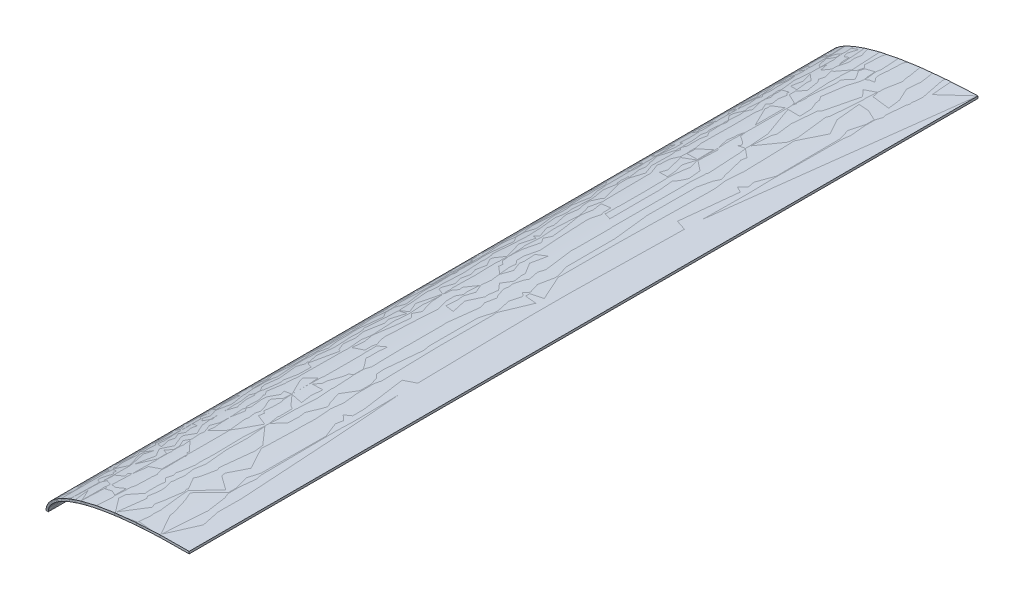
ISO-10303-21;
HEADER;
FILE_DESCRIPTION(('STEP AP214'),'2;1');
FILE_NAME('part.step','',(''),(''),'','','');
FILE_SCHEMA(('AUTOMOTIVE_DESIGN { 1 0 10303 214 1 1 1 1 }'));
ENDSEC;
DATA;
#1=APPLICATION_CONTEXT('core data for automotive mechanical design processes');
#2=APPLICATION_PROTOCOL_DEFINITION('international standard','automotive_design',2000,#1);
#3=PRODUCT_CONTEXT('',#1,'mechanical');
#4=PRODUCT('Part','Part','',(#3));
#5=PRODUCT_RELATED_PRODUCT_CATEGORY('part','',(#4));
#6=PRODUCT_DEFINITION_FORMATION('','',#4);
#7=PRODUCT_DEFINITION_CONTEXT('part definition',#1,'design');
#8=PRODUCT_DEFINITION('design','',#6,#7);
#9=PRODUCT_DEFINITION_SHAPE('','',#8);
#10=(LENGTH_UNIT() NAMED_UNIT(*) SI_UNIT(.MILLI.,.METRE.));
#11=(NAMED_UNIT(*) PLANE_ANGLE_UNIT() SI_UNIT($,.RADIAN.));
#12=(NAMED_UNIT(*) SI_UNIT($,.STERADIAN.) SOLID_ANGLE_UNIT());
#13=UNCERTAINTY_MEASURE_WITH_UNIT(LENGTH_MEASURE(1.E-05),#10,'distance_accuracy_value','');
#14=(GEOMETRIC_REPRESENTATION_CONTEXT(3) GLOBAL_UNCERTAINTY_ASSIGNED_CONTEXT((#13)) GLOBAL_UNIT_ASSIGNED_CONTEXT((#10,
#11,#12)) REPRESENTATION_CONTEXT('',''));
#15=CARTESIAN_POINT('',(0.,0.,0.));
#16=DIRECTION('',(0.,0.,1.));
#17=DIRECTION('',(1.,0.,0.));
#18=AXIS2_PLACEMENT_3D('',#15,#16,#17);
#19=CARTESIAN_POINT('',(264.97401770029,23.9812930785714,0.));
#20=DIRECTION('',(-0.999952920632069,0.00970342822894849,0.));
#21=DIRECTION('',(0.,0.,1.));
#22=AXIS2_PLACEMENT_3D('',#19,#20,#21);
#23=PLANE('',#22);
#24=CARTESIAN_POINT('',(264.959462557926,22.4813636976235,-523.356029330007));
#25=CARTESIAN_POINT('',(264.959462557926,22.4813636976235,-501.549528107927));
#26=CARTESIAN_POINT('',(264.959462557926,22.4813636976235,-479.743026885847));
#27=CARTESIAN_POINT('',(264.959462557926,22.4813636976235,-436.130024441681));
#28=CARTESIAN_POINT('',(264.959462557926,22.4813636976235,-414.323523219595));
#29=CARTESIAN_POINT('',(264.959462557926,22.4813636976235,-370.710520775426));
#30=CARTESIAN_POINT('',(264.959462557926,22.4813636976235,-348.904019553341));
#31=CARTESIAN_POINT('',(264.959462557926,22.4813636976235,-305.291017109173));
#32=CARTESIAN_POINT('',(264.959462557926,22.4813636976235,-283.48451588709));
#33=CARTESIAN_POINT('',(264.959462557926,22.4813636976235,-239.871513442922));
#34=CARTESIAN_POINT('',(264.959462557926,22.4813636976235,-218.065012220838));
#35=CARTESIAN_POINT('',(264.959462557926,22.4813636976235,-174.452009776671));
#36=CARTESIAN_POINT('',(264.959462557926,22.4813636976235,-152.645508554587));
#37=CARTESIAN_POINT('',(264.959462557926,22.4813636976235,-109.032506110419));
#38=CARTESIAN_POINT('',(264.959462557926,22.4813636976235,-87.2260048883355));
#39=CARTESIAN_POINT('',(264.959462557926,22.4813636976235,-43.6130024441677));
#40=CARTESIAN_POINT('',(264.959462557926,22.4813636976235,-21.8065012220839));
#41=CARTESIAN_POINT('',(264.959462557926,22.4813636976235,0.));
#42=B_SPLINE_CURVE_WITH_KNOTS('',3,(#24,#25,#26,#27,#28,#29,#30,#31,#32,#33,#34,#35,#36,#37,#38,
#39,#40,#41),.UNSPECIFIED.,.F.,.F.,(4,2,2,2,2,2,2,2,4),(0.,65.4195036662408,130.839007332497,
196.25851099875,261.678014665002,327.097518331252,392.517021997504,457.936525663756,
523.356029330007),.UNSPECIFIED.);
#43=CARTESIAN_POINT('',(264.959462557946,22.4813636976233,0.));
#44=VERTEX_POINT('',#43);
#45=CARTESIAN_POINT('',(264.959462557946,22.4813636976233,-523.355405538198));
#46=VERTEX_POINT('',#45);
#47=EDGE_CURVE('E164',#44,#46,#42,.F.);
#48=ORIENTED_EDGE('',*,*,#47,.T.);
#49=DIRECTION('',(-0.00970342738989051,-0.999952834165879,0.000415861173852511));
#50=VECTOR('',#49,1.);
#51=CARTESIAN_POINT('',(264.97190581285,23.7636598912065,-523.355938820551));
#52=LINE('',#51,#50);
#53=CARTESIAN_POINT('',(264.97401770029,23.9812930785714,-523.356029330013));
#54=VERTEX_POINT('',#53);
#55=EDGE_CURVE('E127',#46,#54,#52,.F.);
#56=ORIENTED_EDGE('',*,*,#55,.T.);
#57=DIRECTION('',(0.,0.,-1.));
#58=VECTOR('',#57,1.);
#59=CARTESIAN_POINT('',(264.97401770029,23.9812930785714,-261.678014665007));
#60=LINE('',#59,#58);
#61=CARTESIAN_POINT('',(264.97401770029,23.9812930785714,0.));
#62=VERTEX_POINT('',#61);
#63=EDGE_CURVE('E169',#62,#54,#60,.T.);
#64=ORIENTED_EDGE('',*,*,#63,.F.);
#65=DIRECTION('',(0.00970342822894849,0.999952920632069,0.));
#66=VECTOR('',#65,1.);
#67=CARTESIAN_POINT('',(264.97401770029,23.9812930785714,0.));
#68=LINE('',#67,#66);
#69=EDGE_CURVE('E136',#44,#62,#68,.T.);
#70=ORIENTED_EDGE('',*,*,#69,.F.);
#71=EDGE_LOOP('',(#48,#56,#64,#70));
#72=FACE_BOUND('',#71,.T.);
#73=ADVANCED_FACE('F109',(#72),#23,.F.);
#74=CARTESIAN_POINT('',(170.000000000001,2.73064244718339E-07,-523.356029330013));
#75=DIRECTION('',(-0.0338488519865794,-0.999426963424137,0.));
#76=DIRECTION('',(0.,0.,1.));
#77=AXIS2_PLACEMENT_3D('',#74,#75,#76);
#78=PLANE('',#77);
#79=DIRECTION('',(0.,0.,1.));
#80=VECTOR('',#79,1.);
#81=CARTESIAN_POINT('',(170.000000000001,2.73064244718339E-07,-261.678014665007));
#82=LINE('',#81,#80);
#83=CARTESIAN_POINT('',(170.000000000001,2.73064258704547E-07,-519.285714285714));
#84=VERTEX_POINT('',#83);
#85=CARTESIAN_POINT('',(170.000000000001,2.73064244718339E-07,0.));
#86=VERTEX_POINT('',#85);
#87=EDGE_CURVE('E179',#84,#86,#82,.T.);
#88=ORIENTED_EDGE('',*,*,#87,.F.);
#89=DIRECTION('',(0.998511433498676,-0.0338178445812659,-0.0427933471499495));
#90=VECTOR('',#89,1.);
#91=CARTESIAN_POINT('',(170.173923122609,-0.00589020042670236,-519.293168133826));
#92=LINE('',#91,#90);
#93=CARTESIAN_POINT('',(171.499140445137,-0.0507730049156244,-519.349963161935));
#94=VERTEX_POINT('',#93);
#95=EDGE_CURVE('E160',#84,#94,#92,.T.);
#96=ORIENTED_EDGE('',*,*,#95,.T.);
#97=CARTESIAN_POINT('',(171.499140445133,-0.0507730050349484,-523.356029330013));
#98=CARTESIAN_POINT('',(171.499140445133,-0.0507730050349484,-501.549528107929));
#99=CARTESIAN_POINT('',(171.499140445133,-0.0507730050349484,-479.743026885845));
#100=CARTESIAN_POINT('',(171.499140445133,-0.0507730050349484,-436.130024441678));
#101=CARTESIAN_POINT('',(171.499140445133,-0.0507730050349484,-414.323523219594));
#102=CARTESIAN_POINT('',(171.499140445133,-0.0507730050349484,-370.710520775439));
#103=CARTESIAN_POINT('',(171.499140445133,-0.0507730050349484,-348.904019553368));
#104=CARTESIAN_POINT('',(171.499140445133,-0.0507730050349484,-305.291017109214));
#105=CARTESIAN_POINT('',(171.499140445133,-0.0507730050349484,-283.48451588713));
#106=CARTESIAN_POINT('',(171.499140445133,-0.0507730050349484,-239.871513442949));
#107=CARTESIAN_POINT('',(171.499140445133,-0.0507730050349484,-218.065012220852));
#108=CARTESIAN_POINT('',(171.499140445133,-0.0507730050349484,-174.452009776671));
#109=CARTESIAN_POINT('',(171.499140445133,-0.0507730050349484,-152.645508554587));
#110=CARTESIAN_POINT('',(171.499140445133,-0.0507730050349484,-109.032506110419));
#111=CARTESIAN_POINT('',(171.499140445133,-0.0507730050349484,-87.2260048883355));
#112=CARTESIAN_POINT('',(171.499140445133,-0.0507730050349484,-43.6130024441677));
#113=CARTESIAN_POINT('',(171.499140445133,-0.0507730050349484,-21.8065012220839));
#114=CARTESIAN_POINT('',(171.499140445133,-0.0507730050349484,0.));
#115=B_SPLINE_CURVE_WITH_KNOTS('',3,(#97,#98,#99,#100,#101,#102,#103,#104,#105,#106,#107,#108,
#109,#110,#111,#112,#113,#114),.UNSPECIFIED.,.F.,.F.,(4,2,2,2,2,2,2,2,4),(0.,65.4195036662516,
130.839007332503,196.258510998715,261.678014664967,327.097518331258,392.51702199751,
457.936525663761,523.356029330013),.UNSPECIFIED.);
#116=CARTESIAN_POINT('',(171.499140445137,-0.0507730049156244,0.));
#117=VERTEX_POINT('',#116);
#118=EDGE_CURVE('E150',#94,#117,#115,.T.);
#119=ORIENTED_EDGE('',*,*,#118,.T.);
#120=DIRECTION('',(-0.999426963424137,0.0338488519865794,0.));
#121=VECTOR('',#120,1.);
#122=CARTESIAN_POINT('',(170.000000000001,2.73064244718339E-07,0.));
#123=LINE('',#122,#121);
#124=EDGE_CURVE('E121',#117,#86,#123,.T.);
#125=ORIENTED_EDGE('',*,*,#124,.T.);
#126=EDGE_LOOP('',(#88,#96,#119,#125));
#127=FACE_BOUND('',#126,.T.);
#128=ADVANCED_FACE('F111',(#127),#78,.T.);
#129=CARTESIAN_POINT('',(264.97401770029,23.9812930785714,-523.356029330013));
#130=CARTESIAN_POINT('',(264.97401770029,23.9812930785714,0.));
#131=CARTESIAN_POINT('',(259.06213327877,24.0386613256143,-523.356029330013));
#132=CARTESIAN_POINT('',(259.06213327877,24.0386613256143,0.));
#133=CARTESIAN_POINT('',(250.312624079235,23.9796095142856,-523.356029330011));
#134=CARTESIAN_POINT('',(250.312624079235,23.9796095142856,0.));
#135=CARTESIAN_POINT('',(237.516197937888,23.4897304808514,-523.356029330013));
#136=CARTESIAN_POINT('',(237.516197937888,23.4897304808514,0.));
#137=CARTESIAN_POINT('',(226.418388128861,22.7426464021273,-523.356029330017));
#138=CARTESIAN_POINT('',(226.418388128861,22.7426464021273,0.));
#139=CARTESIAN_POINT('',(214.773601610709,21.4508483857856,-523.356029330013));
#140=CARTESIAN_POINT('',(214.773601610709,21.4508483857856,0.));
#141=CARTESIAN_POINT('',(204.074454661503,19.6882781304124,-523.356029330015));
#142=CARTESIAN_POINT('',(204.074454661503,19.6882781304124,0.));
#143=CARTESIAN_POINT('',(195.044831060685,17.6296648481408,-523.356029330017));
#144=CARTESIAN_POINT('',(195.044831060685,17.6296648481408,0.));
#145=CARTESIAN_POINT('',(187.407673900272,15.259174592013,-523.35602933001));
#146=CARTESIAN_POINT('',(187.407673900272,15.259174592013,0.));
#147=CARTESIAN_POINT('',(181.293052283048,12.70549063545,-523.356029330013));
#148=CARTESIAN_POINT('',(181.293052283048,12.70549063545,0.));
#149=CARTESIAN_POINT('',(177.430618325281,10.5002755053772,-523.35602933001));
#150=CARTESIAN_POINT('',(177.430618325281,10.5002755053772,0.));
#151=CARTESIAN_POINT('',(175.036358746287,8.72696177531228,-523.356029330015));
#152=CARTESIAN_POINT('',(175.036358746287,8.72696177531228,0.));
#153=CARTESIAN_POINT('',(173.548896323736,7.44175050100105,-523.356029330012));
#154=CARTESIAN_POINT('',(173.548896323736,7.44175050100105,0.));
#155=CARTESIAN_POINT('',(172.227859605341,5.98003180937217,-523.35602933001));
#156=CARTESIAN_POINT('',(172.227859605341,5.98003180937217,0.));
#157=CARTESIAN_POINT('',(171.095261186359,4.29817637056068,-523.356029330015));
#158=CARTESIAN_POINT('',(171.095261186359,4.29817637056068,0.));
#159=CARTESIAN_POINT('',(170.579998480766,3.1750202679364,-523.356029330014));
#160=CARTESIAN_POINT('',(170.579998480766,3.1750202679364,0.));
#161=CARTESIAN_POINT('',(170.129806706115,1.64978223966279,-523.356029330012));
#162=CARTESIAN_POINT('',(170.129806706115,1.64978223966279,0.));
#163=CARTESIAN_POINT('',(170.027919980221,0.824370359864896,-523.356029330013));
#164=CARTESIAN_POINT('',(170.027919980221,0.824370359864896,0.));
#165=CARTESIAN_POINT('',(170.000000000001,2.73064244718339E-07,-523.356029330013));
#166=CARTESIAN_POINT('',(170.000000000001,2.73064244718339E-07,0.));
#167=B_SPLINE_SURFACE_WITH_KNOTS('',3,1,((#129,#130),(#131,#132),(#133,#134),(#135,#136),(#137,
#138),(#139,#140),(#141,#142),(#143,#144),(#145,#146),(#147,#148),(#149,#150),(#151,#152),(#153,
#154),(#155,#156),(#157,#158),(#159,#160),(#161,#162),(#163,#164),(#165,#166)),.UNSPECIFIED.,
.F.,.F.,.F.,(4,1,1,1,1,1,1,1,1,1,1,1,1,1,2,4),(2,2),(0.,0.172478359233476,0.25521084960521,
0.373568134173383,0.496916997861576,0.596902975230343,0.689792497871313,0.766941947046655,
0.829984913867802,0.882861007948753,0.896304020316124,0.916874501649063,0.940133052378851,
0.953610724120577,0.975936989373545,1.),(0.,1.),.UNSPECIFIED.);
#168=CARTESIAN_POINT('',(264.97401770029,23.9812930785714,-523.356029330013));
#169=CARTESIAN_POINT('',(263.359788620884,23.9969541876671,-523.286848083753));
#170=CARTESIAN_POINT('',(261.745476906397,24.0053675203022,-523.217663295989));
#171=CARTESIAN_POINT('',(258.51663793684,24.0065245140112,-523.079284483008));
#172=CARTESIAN_POINT('',(256.902110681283,23.9992661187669,-523.01009045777));
#173=CARTESIAN_POINT('',(253.673137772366,23.967900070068,-522.871705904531));
#174=CARTESIAN_POINT('',(252.05869212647,23.9437916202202,-522.802515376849));
#175=CARTESIAN_POINT('',(248.839730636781,23.8777991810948,-522.664559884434));
#176=CARTESIAN_POINT('',(247.235212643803,23.8360213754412,-522.595794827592));
#177=CARTESIAN_POINT('',(244.026845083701,23.7333755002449,-522.45829336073));
#178=CARTESIAN_POINT('',(242.422995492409,23.6725081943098,-522.389556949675));
#179=CARTESIAN_POINT('',(239.216267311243,23.5299218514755,-522.252125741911));
#180=CARTESIAN_POINT('',(237.613388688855,23.4482035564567,-522.183430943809));
#181=CARTESIAN_POINT('',(234.808604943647,23.2852418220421,-522.063225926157));
#182=CARTESIAN_POINT('',(233.606410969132,23.2089643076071,-522.011703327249));
#183=CARTESIAN_POINT('',(231.202943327,23.0426914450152,-521.908697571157));
#184=CARTESIAN_POINT('',(230.001669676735,22.9526958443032,-521.857214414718));
#185=CARTESIAN_POINT('',(227.600224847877,22.758162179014,-521.754295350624));
#186=CARTESIAN_POINT('',(226.400053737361,22.6536232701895,-521.702859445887));
#187=CARTESIAN_POINT('',(224.001009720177,22.4289457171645,-521.600043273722));
#188=CARTESIAN_POINT('',(222.802136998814,22.3088050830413,-521.548663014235));
#189=CARTESIAN_POINT('',(220.39795448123,22.0506456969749,-521.445626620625));
#190=CARTESIAN_POINT('',(219.192657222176,21.9125095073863,-521.393971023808));
#191=CARTESIAN_POINT('',(216.784355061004,21.6176362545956,-521.290758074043));
#192=CARTESIAN_POINT('',(215.581350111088,21.4608995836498,-521.239200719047));
#193=CARTESIAN_POINT('',(213.178341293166,21.1275404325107,-521.13621462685));
#194=CARTESIAN_POINT('',(211.978336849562,20.9509221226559,-521.084785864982));
#195=CARTESIAN_POINT('',(209.582155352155,20.5755973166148,-520.982092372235));
#196=CARTESIAN_POINT('',(208.38597719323,20.3768979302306,-520.930827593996));
#197=CARTESIAN_POINT('',(206.22552285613,19.9952226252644,-520.838236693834));
#198=CARTESIAN_POINT('',(205.260502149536,19.8164684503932,-520.796878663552));
#199=CARTESIAN_POINT('',(203.333778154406,19.4417917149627,-520.714304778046));
#200=CARTESIAN_POINT('',(202.372074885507,19.2458690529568,-520.673088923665));
#201=CARTESIAN_POINT('',(200.452408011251,18.8346735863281,-520.590817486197));
#202=CARTESIAN_POINT('',(199.494445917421,18.619393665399,-520.54976196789));
#203=CARTESIAN_POINT('',(198.060909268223,18.280234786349,-520.488324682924));
#204=CARTESIAN_POINT('',(197.583421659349,18.1644206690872,-520.467860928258));
#205=CARTESIAN_POINT('',(196.62985033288,17.9271280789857,-520.426993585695));
#206=CARTESIAN_POINT('',(196.153766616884,17.8056495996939,-520.406589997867));
#207=CARTESIAN_POINT('',(195.202414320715,17.5565785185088,-520.365817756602));
#208=CARTESIAN_POINT('',(194.727148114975,17.4289768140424,-520.345449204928));
#209=CARTESIAN_POINT('',(193.77834113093,17.1675198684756,-520.304786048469));
#210=CARTESIAN_POINT('',(193.304800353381,17.0336646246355,-520.284491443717));
#211=CARTESIAN_POINT('',(191.897606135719,16.6249155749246,-520.224183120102));
#212=CARTESIAN_POINT('',(190.96678523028,16.3400875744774,-520.184290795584));
#213=CARTESIAN_POINT('',(189.577990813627,15.8898054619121,-520.12477103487));
#214=CARTESIAN_POINT('',(189.116269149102,15.7358606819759,-520.104982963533));
#215=CARTESIAN_POINT('',(188.195620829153,15.4197751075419,-520.065526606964));
#216=CARTESIAN_POINT('',(187.736694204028,15.2576342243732,-520.04585832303));
#217=CARTESIAN_POINT('',(186.822555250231,14.9249398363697,-520.006680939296));
#218=CARTESIAN_POINT('',(186.367338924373,14.7543973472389,-519.987171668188));
#219=CARTESIAN_POINT('',(185.460590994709,14.4037647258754,-519.948311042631));
#220=CARTESIAN_POINT('',(185.009059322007,14.2236747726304,-519.928959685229));
#221=CARTESIAN_POINT('',(184.111229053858,13.8532520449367,-519.890481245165));
#222=CARTESIAN_POINT('',(183.664921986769,13.6629398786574,-519.871353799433));
#223=CARTESIAN_POINT('',(182.77736117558,13.2707602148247,-519.833315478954));
#224=CARTESIAN_POINT('',(182.336107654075,13.0688922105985,-519.814404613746));
#225=CARTESIAN_POINT('',(181.678934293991,12.7568426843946,-519.786240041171));
#226=CARTESIAN_POINT('',(181.460785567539,12.651348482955,-519.776890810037));
#227=CARTESIAN_POINT('',(181.026068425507,12.4371480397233,-519.758260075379));
#228=CARTESIAN_POINT('',(180.809500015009,12.3284417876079,-519.748978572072));
#229=CARTESIAN_POINT('',(180.162465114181,11.9971941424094,-519.721248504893));
#230=CARTESIAN_POINT('',(179.734608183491,11.769495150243,-519.702911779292));
#231=CARTESIAN_POINT('',(178.923595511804,11.3182696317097,-519.668154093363));
#232=CARTESIAN_POINT('',(178.539726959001,11.0960280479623,-519.651702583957));
#233=CARTESIAN_POINT('',(177.78079783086,10.6367657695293,-519.619177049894));
#234=CARTESIAN_POINT('',(177.405738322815,10.3997432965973,-519.603103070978));
#235=CARTESIAN_POINT('',(176.85056130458,10.0317422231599,-519.579309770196));
#236=CARTESIAN_POINT('',(176.666443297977,9.90678314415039,-519.571418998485));
#237=CARTESIAN_POINT('',(176.301105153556,9.65267618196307,-519.555761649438));
#238=CARTESIAN_POINT('',(176.119885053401,9.5235282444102,-519.547995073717));
#239=CARTESIAN_POINT('',(175.76073837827,9.26070040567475,-519.532603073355));
#240=CARTESIAN_POINT('',(175.582811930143,9.12702033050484,-519.524977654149));
#241=CARTESIAN_POINT('',(175.230757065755,8.85475368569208,-519.509889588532));
#242=CARTESIAN_POINT('',(175.056628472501,8.71616734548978,-519.502426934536));
#243=CARTESIAN_POINT('',(174.652341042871,8.38424853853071,-519.485100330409));
#244=CARTESIAN_POINT('',(174.423941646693,8.18875696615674,-519.475311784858));
#245=CARTESIAN_POINT('',(173.976244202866,7.78756217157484,-519.456124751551));
#246=CARTESIAN_POINT('',(173.756946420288,7.5818586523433,-519.446726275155));
#247=CARTESIAN_POINT('',(173.328891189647,7.15958720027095,-519.428381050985));
#248=CARTESIAN_POINT('',(173.120136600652,6.94301635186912,-519.419434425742));
#249=CARTESIAN_POINT('',(172.716268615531,6.49920486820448,-519.402125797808));
#250=CARTESIAN_POINT('',(172.521098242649,6.27201643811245,-519.393761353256));
#251=CARTESIAN_POINT('',(172.145741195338,5.80559784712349,-519.377674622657));
#252=CARTESIAN_POINT('',(171.96555115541,5.5663704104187,-519.369952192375));
#253=CARTESIAN_POINT('',(171.622745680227,5.07569016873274,-519.355260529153));
#254=CARTESIAN_POINT('',(171.460121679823,4.82424340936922,-519.348290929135));
#255=CARTESIAN_POINT('',(171.216185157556,4.41222200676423,-519.337836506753));
#256=CARTESIAN_POINT('',(171.128352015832,4.25549411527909,-519.33407222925));
#257=CARTESIAN_POINT('',(170.960905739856,3.9377290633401,-519.32689596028));
#258=CARTESIAN_POINT('',(170.881290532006,3.77669300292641,-519.323483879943));
#259=CARTESIAN_POINT('',(170.731248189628,3.45039992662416,-519.317053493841));
#260=CARTESIAN_POINT('',(170.660819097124,3.28514381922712,-519.314035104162));
#261=CARTESIAN_POINT('',(170.5628730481,3.0343800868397,-519.309837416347));
#262=CARTESIAN_POINT('',(170.531522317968,2.95035890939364,-519.308493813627));
#263=CARTESIAN_POINT('',(170.471501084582,2.78136043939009,-519.305921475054));
#264=CARTESIAN_POINT('',(170.442830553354,2.69638315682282,-519.304692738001));
#265=CARTESIAN_POINT('',(170.388279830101,2.52553139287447,-519.302354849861));
#266=CARTESIAN_POINT('',(170.362399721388,2.43965688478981,-519.301245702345));
#267=CARTESIAN_POINT('',(170.313694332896,2.26704357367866,-519.299158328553));
#268=CARTESIAN_POINT('',(170.290869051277,2.18030477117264,-519.298180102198));
#269=CARTESIAN_POINT('',(170.248136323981,2.00614911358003,-519.296348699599));
#270=CARTESIAN_POINT('',(170.228227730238,1.91873253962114,-519.295495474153));
#271=CARTESIAN_POINT('',(170.191183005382,1.74331611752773,-519.293907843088));
#272=CARTESIAN_POINT('',(170.17404681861,1.65531628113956,-519.293173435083));
#273=CARTESIAN_POINT('',(170.142766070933,1.480894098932,-519.291832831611));
#274=CARTESIAN_POINT('',(170.128561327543,1.3944825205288,-519.291224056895));
#275=CARTESIAN_POINT('',(170.102518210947,1.22131906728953,-519.290107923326));
#276=CARTESIAN_POINT('',(170.090679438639,1.13456725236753,-519.28960054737));
#277=CARTESIAN_POINT('',(170.069223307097,0.960789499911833,-519.288680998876));
#278=CARTESIAN_POINT('',(170.059605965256,0.87376356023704,-519.288268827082));
#279=CARTESIAN_POINT('',(170.042444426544,0.699440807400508,-519.287533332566));
#280=CARTESIAN_POINT('',(170.034901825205,0.6121438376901,-519.287210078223));
#281=CARTESIAN_POINT('',(170.02175884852,0.437411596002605,-519.286646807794));
#282=CARTESIAN_POINT('',(170.016158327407,0.349976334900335,-519.28640678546));
#283=CARTESIAN_POINT('',(170.006761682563,0.175035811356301,-519.28600407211));
#284=CARTESIAN_POINT('',(170.002964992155,0.0875305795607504,-519.285841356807));
#285=CARTESIAN_POINT('',(170.000000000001,2.73064244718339E-07,-519.285714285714));
#286=B_SPLINE_CURVE_WITH_KNOTS('',3,(#168,#169,#170,#171,#172,#173,#174,#175,#176,#177,#178,
#179,#180,#181,#182,#183,#184,#185,#186,#187,#188,#189,#190,#191,#192,#193,#194,#195,#196,#197,
#198,#199,#200,#201,#202,#203,#204,#205,#206,#207,#208,#209,#210,#211,#212,#213,#214,#215,#216,
#217,#218,#219,#220,#221,#222,#223,#224,#225,#226,#227,#228,#229,#230,#231,#232,#233,#234,#235,
#236,#237,#238,#239,#240,#241,#242,#243,#244,#245,#246,#247,#248,#249,#250,#251,#252,#253,#254,
#255,#256,#257,#258,#259,#260,#261,#262,#263,#264,#265,#266,#267,#268,#269,#270,#271,#272,#273,
#274,#275,#276,#277,#278,#279,#280,#281,#282,#283,#284,#285),.UNSPECIFIED.,.F.,.F.,(4,2,2,2,2,2,
2,2,2,2,2,2,2,2,2,2,2,2,2,2,2,2,2,2,2,2,2,2,2,2,2,2,2,2,2,2,2,2,2,2,2,2,2,2,2,2,2,2,2,2,2,2,2,2,
2,2,2,2,4),(0.,4.84736253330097,9.69536113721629,14.5435888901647,19.363086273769,
24.1823908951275,29.0015240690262,32.6185923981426,36.235727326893,39.8530723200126,
43.4708791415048,47.1136038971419,50.7562518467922,54.3981371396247,58.0388531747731,
60.9856357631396,63.9324357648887,66.8803235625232,68.3555691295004,69.8308163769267,
71.3083290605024,72.7858423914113,75.7080103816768,77.1692837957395,78.6305730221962,
80.0899947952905,81.5493892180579,83.0059445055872,84.4625637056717,85.1900339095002,
85.9175064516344,87.3722498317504,88.7035729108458,90.0350564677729,90.7029818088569,
91.3709158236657,92.0388755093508,92.7068039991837,93.6089051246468,94.511032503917,
95.4134032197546,96.3117271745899,97.2098487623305,98.1075304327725,98.6464317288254,
99.1851967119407,99.7238466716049,99.9928780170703,100.261906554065,100.530943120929,
100.79997952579,101.068909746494,101.337834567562,101.600520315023,101.863161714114,
102.125805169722,102.388650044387,102.651475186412,102.914217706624),.UNSPECIFIED.);
#287=EDGE_CURVE('E158',#54,#84,#286,.T.);
#288=CARTESIAN_POINT('',(264.97401770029,23.9812930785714,0.));
#289=CARTESIAN_POINT('',(259.06213327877,24.0386613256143,0.));
#290=CARTESIAN_POINT('',(250.312624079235,23.9796095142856,0.));
#291=CARTESIAN_POINT('',(237.516197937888,23.4897304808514,0.));
#292=CARTESIAN_POINT('',(226.418388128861,22.7426464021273,0.));
#293=CARTESIAN_POINT('',(214.773601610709,21.4508483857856,0.));
#294=CARTESIAN_POINT('',(204.074454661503,19.6882781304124,0.));
#295=CARTESIAN_POINT('',(195.044831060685,17.6296648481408,0.));
#296=CARTESIAN_POINT('',(187.407673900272,15.259174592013,0.));
#297=CARTESIAN_POINT('',(181.293052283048,12.70549063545,0.));
#298=CARTESIAN_POINT('',(177.430618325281,10.5002755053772,0.));
#299=CARTESIAN_POINT('',(175.036358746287,8.72696177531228,0.));
#300=CARTESIAN_POINT('',(173.548896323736,7.44175050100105,0.));
#301=CARTESIAN_POINT('',(172.227859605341,5.98003180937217,0.));
#302=CARTESIAN_POINT('',(171.095261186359,4.29817637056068,0.));
#303=CARTESIAN_POINT('',(170.579998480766,3.1750202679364,0.));
#304=CARTESIAN_POINT('',(170.129806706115,1.64978223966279,0.));
#305=CARTESIAN_POINT('',(170.027919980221,0.824370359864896,0.));
#306=CARTESIAN_POINT('',(170.000000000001,2.73064244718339E-07,0.));
#307=B_SPLINE_CURVE_WITH_KNOTS('',3,(#288,#289,#290,#291,#292,#293,#294,#295,#296,#297,#298,
#299,#300,#301,#302,#303,#304,#305,#306),.UNSPECIFIED.,.F.,.F.,(4,1,1,1,1,1,1,1,1,1,1,1,1,1,2,
4),(0.,0.172478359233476,0.25521084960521,0.373568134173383,0.496916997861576,0.596902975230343,
0.689792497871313,0.766941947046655,0.829984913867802,0.882861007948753,0.896304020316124,
0.916874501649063,0.940133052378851,0.953610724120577,0.975936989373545,1.),.UNSPECIFIED.);
#308=EDGE_CURVE('E173',#86,#62,#307,.F.);
#309=ORIENTED_EDGE('',*,*,#63,.T.);
#310=ORIENTED_EDGE('',*,*,#287,.T.);
#311=ORIENTED_EDGE('',*,*,#87,.T.);
#312=ORIENTED_EDGE('',*,*,#308,.T.);
#313=EDGE_LOOP('',(#309,#310,#311,#312));
#314=FACE_BOUND('',#313,.T.);
#315=ADVANCED_FACE('F172',(#314),#167,.T.);
#316=CARTESIAN_POINT('',(264.97401770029,23.9812930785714,-523.356029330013));
#317=CARTESIAN_POINT('',(264.97401770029,23.9812930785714,0.));
#318=CARTESIAN_POINT('',(259.06213327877,24.0386613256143,-523.356029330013));
#319=CARTESIAN_POINT('',(259.06213327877,24.0386613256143,0.));
#320=CARTESIAN_POINT('',(250.312624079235,23.9796095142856,-523.356029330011));
#321=CARTESIAN_POINT('',(250.312624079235,23.9796095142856,0.));
#322=CARTESIAN_POINT('',(237.516197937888,23.4897304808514,-523.356029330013));
#323=CARTESIAN_POINT('',(237.516197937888,23.4897304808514,0.));
#324=CARTESIAN_POINT('',(226.418388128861,22.7426464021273,-523.356029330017));
#325=CARTESIAN_POINT('',(226.418388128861,22.7426464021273,0.));
#326=CARTESIAN_POINT('',(214.773601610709,21.4508483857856,-523.356029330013));
#327=CARTESIAN_POINT('',(214.773601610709,21.4508483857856,0.));
#328=CARTESIAN_POINT('',(204.074454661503,19.6882781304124,-523.356029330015));
#329=CARTESIAN_POINT('',(204.074454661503,19.6882781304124,0.));
#330=CARTESIAN_POINT('',(195.044831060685,17.6296648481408,-523.356029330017));
#331=CARTESIAN_POINT('',(195.044831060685,17.6296648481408,0.));
#332=CARTESIAN_POINT('',(187.407673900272,15.259174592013,-523.35602933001));
#333=CARTESIAN_POINT('',(187.407673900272,15.259174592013,0.));
#334=CARTESIAN_POINT('',(181.293052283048,12.70549063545,-523.356029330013));
#335=CARTESIAN_POINT('',(181.293052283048,12.70549063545,0.));
#336=CARTESIAN_POINT('',(177.430618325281,10.5002755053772,-523.35602933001));
#337=CARTESIAN_POINT('',(177.430618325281,10.5002755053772,0.));
#338=CARTESIAN_POINT('',(175.036358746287,8.72696177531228,-523.356029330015));
#339=CARTESIAN_POINT('',(175.036358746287,8.72696177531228,0.));
#340=CARTESIAN_POINT('',(173.548896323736,7.44175050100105,-523.356029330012));
#341=CARTESIAN_POINT('',(173.548896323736,7.44175050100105,0.));
#342=CARTESIAN_POINT('',(172.227859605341,5.98003180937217,-523.35602933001));
#343=CARTESIAN_POINT('',(172.227859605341,5.98003180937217,0.));
#344=CARTESIAN_POINT('',(171.095261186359,4.29817637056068,-523.356029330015));
#345=CARTESIAN_POINT('',(171.095261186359,4.29817637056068,0.));
#346=CARTESIAN_POINT('',(170.579998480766,3.1750202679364,-523.356029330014));
#347=CARTESIAN_POINT('',(170.579998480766,3.1750202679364,0.));
#348=CARTESIAN_POINT('',(170.129806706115,1.64978223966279,-523.356029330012));
#349=CARTESIAN_POINT('',(170.129806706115,1.64978223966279,0.));
#350=CARTESIAN_POINT('',(170.027919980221,0.824370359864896,-523.356029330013));
#351=CARTESIAN_POINT('',(170.027919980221,0.824370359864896,0.));
#352=CARTESIAN_POINT('',(170.000000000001,2.73064244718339E-07,-523.356029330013));
#353=CARTESIAN_POINT('',(170.000000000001,2.73064244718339E-07,0.));
#354=B_SPLINE_SURFACE_WITH_KNOTS('',3,1,((#316,#317),(#318,#319),(#320,#321),(#322,#323),(#324,
#325),(#326,#327),(#328,#329),(#330,#331),(#332,#333),(#334,#335),(#336,#337),(#338,#339),(#340,
#341),(#342,#343),(#344,#345),(#346,#347),(#348,#349),(#350,#351),(#352,#353)),.UNSPECIFIED.,
.F.,.F.,.F.,(4,1,1,1,1,1,1,1,1,1,1,1,1,1,2,4),(2,2),(0.,0.172478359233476,0.25521084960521,
0.373568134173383,0.496916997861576,0.596902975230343,0.689792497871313,0.766941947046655,
0.829984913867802,0.882861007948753,0.896304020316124,0.916874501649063,0.940133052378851,
0.953610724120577,0.975936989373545,1.),(0.,1.),.UNSPECIFIED.);
#355=OFFSET_SURFACE('',#354,-1.5,.F.);
#356=CARTESIAN_POINT('',(264.959462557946,22.4813636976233,-523.355405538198));
#357=CARTESIAN_POINT('',(263.388133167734,22.4966093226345,-523.288062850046));
#358=CARTESIAN_POINT('',(261.816725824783,22.5049671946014,-523.220716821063));
#359=CARTESIAN_POINT('',(258.67372436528,22.5068166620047,-523.086016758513));
#360=CARTESIAN_POINT('',(257.102130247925,22.5003065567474,-523.018662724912));
#361=CARTESIAN_POINT('',(253.959020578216,22.4713247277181,-522.883958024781));
#362=CARTESIAN_POINT('',(252.387505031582,22.4488523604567,-522.816607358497));
#363=CARTESIAN_POINT('',(249.251935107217,22.3870301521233,-522.68222579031));
#364=CARTESIAN_POINT('',(247.687879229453,22.3477573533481,-522.61519482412));
#365=CARTESIAN_POINT('',(244.560371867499,22.2511548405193,-522.481158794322));
#366=CARTESIAN_POINT('',(242.9969203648,22.1938257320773,-522.41415372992));
#367=CARTESIAN_POINT('',(239.870893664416,22.0594613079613,-522.280181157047));
#368=CARTESIAN_POINT('',(238.308318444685,21.9824265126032,-522.21321364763));
#369=CARTESIAN_POINT('',(235.574076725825,21.8288110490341,-522.096031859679));
#370=CARTESIAN_POINT('',(234.402146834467,21.7569122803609,-522.045806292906));
#371=CARTESIAN_POINT('',(232.059127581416,21.6001932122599,-521.945391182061));
#372=CARTESIAN_POINT('',(230.888038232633,21.5153727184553,-521.895201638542));
#373=CARTESIAN_POINT('',(228.546879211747,21.3320120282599,-521.794866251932));
#374=CARTESIAN_POINT('',(227.376809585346,21.2334712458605,-521.744720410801));
#375=CARTESIAN_POINT('',(225.037869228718,21.0217944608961,-521.644480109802));
#376=CARTESIAN_POINT('',(223.868998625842,20.9086570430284,-521.594385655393));
#377=CARTESIAN_POINT('',(221.526574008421,20.665832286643,-521.493996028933));
#378=CARTESIAN_POINT('',(220.35302889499,20.536058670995,-521.443701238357));
#379=CARTESIAN_POINT('',(218.007989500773,20.2591571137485,-521.343199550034));
#380=CARTESIAN_POINT('',(216.836495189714,20.1120294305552,-521.292992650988));
#381=CARTESIAN_POINT('',(215.081215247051,19.8773752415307,-521.217766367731));
#382=CARTESIAN_POINT('',(214.496491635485,19.7968364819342,-521.192706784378));
#383=CARTESIAN_POINT('',(213.327728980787,19.6309284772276,-521.14261695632));
#384=CARTESIAN_POINT('',(212.743689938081,19.5455592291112,-521.117586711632));
#385=CARTESIAN_POINT('',(210.99299019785,19.2818225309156,-521.042556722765));
#386=CARTESIAN_POINT('',(209.82746773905,19.0957890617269,-520.992605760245));
#387=CARTESIAN_POINT('',(207.723933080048,18.7390464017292,-520.902454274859));
#388=CARTESIAN_POINT('',(206.785255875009,18.5722659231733,-520.862225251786));
#389=CARTESIAN_POINT('',(205.379458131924,18.3101680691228,-520.801976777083));
#390=CARTESIAN_POINT('',(204.911224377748,18.2208134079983,-520.781909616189));
#391=CARTESIAN_POINT('',(203.975558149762,18.0379975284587,-520.74180963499));
#392=CARTESIAN_POINT('',(203.508125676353,17.9445363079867,-520.721776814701));
#393=CARTESIAN_POINT('',(202.106905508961,17.6575774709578,-520.661724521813));
#394=CARTESIAN_POINT('',(201.17443987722,17.4575500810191,-520.621761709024));
#395=CARTESIAN_POINT('',(199.313296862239,17.0378298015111,-520.541998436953));
#396=CARTESIAN_POINT('',(198.384622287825,16.8181243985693,-520.50219809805));
#397=CARTESIAN_POINT('',(196.531555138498,16.3568471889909,-520.422780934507));
#398=CARTESIAN_POINT('',(195.607168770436,16.1152503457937,-520.383164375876));
#399=CARTESIAN_POINT('',(193.772988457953,15.6104381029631,-520.304556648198));
#400=CARTESIAN_POINT('',(192.863137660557,15.3474312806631,-520.265563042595));
#401=CARTESIAN_POINT('',(191.504624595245,14.932279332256,-520.207341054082));
#402=CARTESIAN_POINT('',(191.052806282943,14.7904467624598,-520.187977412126));
#403=CARTESIAN_POINT('',(190.151534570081,14.4994205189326,-520.149351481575));
#404=CARTESIAN_POINT('',(189.702081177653,14.350226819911,-520.130089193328));
#405=CARTESIAN_POINT('',(188.80628915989,14.0441251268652,-520.091698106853));
#406=CARTESIAN_POINT('',(188.359947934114,13.8872247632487,-520.072569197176));
#407=CARTESIAN_POINT('',(187.470247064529,13.5651633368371,-520.034439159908));
#408=CARTESIAN_POINT('',(187.026887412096,13.4000022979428,-520.015438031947));
#409=CARTESIAN_POINT('',(186.144311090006,13.0607924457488,-519.977613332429));
#410=CARTESIAN_POINT('',(185.705089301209,12.8867570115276,-519.958789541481));
#411=CARTESIAN_POINT('',(184.830786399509,12.5285213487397,-519.921319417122));
#412=CARTESIAN_POINT('',(184.395705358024,12.3443209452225,-519.902673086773));
#413=CARTESIAN_POINT('',(183.53076379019,11.9649304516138,-519.865604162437));
#414=CARTESIAN_POINT('',(183.100899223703,11.7697496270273,-519.847181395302));
#415=CARTESIAN_POINT('',(182.460389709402,11.4679209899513,-519.819730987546));
#416=CARTESIAN_POINT('',(182.247605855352,11.3658042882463,-519.810611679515));
#417=CARTESIAN_POINT('',(181.823562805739,11.1584494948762,-519.79243840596));
#418=CARTESIAN_POINT('',(181.612303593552,11.0532114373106,-519.783384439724));
#419=CARTESIAN_POINT('',(181.142891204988,10.8147530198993,-519.763266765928));
#420=CARTESIAN_POINT('',(180.885169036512,10.6806804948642,-519.752221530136));
#421=CARTESIAN_POINT('',(180.372655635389,10.4069931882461,-519.730256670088));
#422=CARTESIAN_POINT('',(180.117864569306,10.2673780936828,-519.71933705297));
#423=CARTESIAN_POINT('',(179.611651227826,9.98211876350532,-519.697642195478));
#424=CARTESIAN_POINT('',(179.360229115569,9.83647423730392,-519.686866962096));
#425=CARTESIAN_POINT('',(178.86062053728,9.53830294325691,-519.665455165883));
#426=CARTESIAN_POINT('',(178.612443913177,9.38575963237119,-519.654819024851));
#427=CARTESIAN_POINT('',(178.120511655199,9.0736701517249,-519.633736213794));
#428=CARTESIAN_POINT('',(177.876756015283,8.91412399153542,-519.623289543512));
#429=CARTESIAN_POINT('',(177.514895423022,8.66923307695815,-519.607781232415));
#430=CARTESIAN_POINT('',(177.394903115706,8.58667349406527,-519.602638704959));
#431=CARTESIAN_POINT('',(177.156247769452,8.41965217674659,-519.592410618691));
#432=CARTESIAN_POINT('',(177.037584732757,8.33519043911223,-519.587325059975));
#433=CARTESIAN_POINT('',(176.681423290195,8.07705408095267,-519.572060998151));
#434=CARTESIAN_POINT('',(176.446166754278,7.90025423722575,-519.561978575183));
#435=CARTESIAN_POINT('',(175.982916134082,7.53733070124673,-519.542124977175));
#436=CARTESIAN_POINT('',(175.754922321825,7.35120666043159,-519.532353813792));
#437=CARTESIAN_POINT('',(175.30748529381,6.96864354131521,-519.513177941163));
#438=CARTESIAN_POINT('',(175.088046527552,6.77219921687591,-519.503773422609));
#439=CARTESIAN_POINT('',(174.766883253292,6.4695784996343,-519.490009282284));
#440=CARTESIAN_POINT('',(174.661282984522,6.36750617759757,-519.485483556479));
#441=CARTESIAN_POINT('',(174.452888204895,6.1605336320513,-519.476552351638));
#442=CARTESIAN_POINT('',(174.350093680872,6.05563342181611,-519.472146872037));
#443=CARTESIAN_POINT('',(174.046454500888,5.73654318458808,-519.459133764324));
#444=CARTESIAN_POINT('',(173.850254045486,5.5178699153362,-519.450725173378));
#445=CARTESIAN_POINT('',(173.47325495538,5.06790651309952,-519.434568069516));
#446=CARTESIAN_POINT('',(173.292441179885,4.83662915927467,-519.42681890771));
#447=CARTESIAN_POINT('',(172.981818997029,4.40590559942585,-519.413506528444));
#448=CARTESIAN_POINT('',(172.848845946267,4.20875741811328,-519.407807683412));
#449=CARTESIAN_POINT('',(172.659976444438,3.90647224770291,-519.39971327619));
#450=CARTESIAN_POINT('',(172.598790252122,3.8046266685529,-519.397091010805));
#451=CARTESIAN_POINT('',(172.480224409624,3.59874324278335,-519.392009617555));
#452=CARTESIAN_POINT('',(172.422844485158,3.4947055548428,-519.389550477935));
#453=CARTESIAN_POINT('',(172.294113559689,3.24983683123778,-519.384033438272));
#454=CARTESIAN_POINT('',(172.224370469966,3.10815332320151,-519.381044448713));
#455=CARTESIAN_POINT('',(172.093363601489,2.82095068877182,-519.375429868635));
#456=CARTESIAN_POINT('',(172.032096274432,2.6754331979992,-519.372804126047));
#457=CARTESIAN_POINT('',(171.947447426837,2.45448572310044,-519.369176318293));
#458=CARTESIAN_POINT('',(171.92045187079,2.38043017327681,-519.368019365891));
#459=CARTESIAN_POINT('',(171.869007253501,2.23143840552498,-519.365814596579));
#460=CARTESIAN_POINT('',(171.844558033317,2.15650224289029,-519.364766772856));
#461=CARTESIAN_POINT('',(171.803973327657,2.02403405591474,-519.363027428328));
#462=CARTESIAN_POINT('',(171.787257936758,1.96667972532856,-519.362311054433));
#463=CARTESIAN_POINT('',(171.755519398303,1.85150590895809,-519.360950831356));
#464=CARTESIAN_POINT('',(171.740496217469,1.79368643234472,-519.360306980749));
#465=CARTESIAN_POINT('',(171.697788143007,1.61959258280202,-519.3584766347));
#466=CARTESIAN_POINT('',(171.672478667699,1.50272868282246,-519.357391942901));
#467=CARTESIAN_POINT('',(171.627587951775,1.26782360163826,-519.355468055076));
#468=CARTESIAN_POINT('',(171.608011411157,1.1497815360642,-519.354629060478));
#469=CARTESIAN_POINT('',(171.573810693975,0.911712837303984,-519.353163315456));
#470=CARTESIAN_POINT('',(171.559241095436,0.791678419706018,-519.35253890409));
#471=CARTESIAN_POINT('',(171.53474896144,0.551236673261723,-519.351489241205));
#472=CARTESIAN_POINT('',(171.524822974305,0.430829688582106,-519.351063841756));
#473=CARTESIAN_POINT('',(171.509066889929,0.190036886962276,-519.350388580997));
#474=CARTESIAN_POINT('',(171.503226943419,0.0696517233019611,-519.350138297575));
#475=CARTESIAN_POINT('',(171.499140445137,-0.0507730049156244,-519.349963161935));
#476=B_SPLINE_CURVE_WITH_KNOTS('',3,(#356,#357,#358,#359,#360,#361,#362,#363,#364,#365,#366,
#367,#368,#369,#370,#371,#372,#373,#374,#375,#376,#377,#378,#379,#380,#381,#382,#383,#384,#385,
#386,#387,#388,#389,#390,#391,#392,#393,#394,#395,#396,#397,#398,#399,#400,#401,#402,#403,#404,
#405,#406,#407,#408,#409,#410,#411,#412,#413,#414,#415,#416,#417,#418,#419,#420,#421,#422,#423,
#424,#425,#426,#427,#428,#429,#430,#431,#432,#433,#434,#435,#436,#437,#438,#439,#440,#441,#442,
#443,#444,#445,#446,#447,#448,#449,#450,#451,#452,#453,#454,#455,#456,#457,#458,#459,#460,#461,
#462,#463,#464,#465,#466,#467,#468,#469,#470,#471,#472,#473,#474,#475),.UNSPECIFIED.,.F.,.F.,(4,
2,2,2,2,2,2,2,2,2,2,2,2,2,2,2,2,2,2,2,2,2,2,2,2,2,2,2,2,2,2,2,2,2,2,2,2,2,2,2,2,2,2,2,2,2,2,2,2,
2,2,2,2,2,2,2,2,2,2,4),(0.,4.71853866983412,9.43761710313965,14.1568857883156,18.8547413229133,
23.5524393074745,28.2500132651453,31.7755710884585,35.3011819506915,38.8269434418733,
42.3530470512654,45.8982391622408,49.4433784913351,51.2156883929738,52.9879993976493,
56.531775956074,59.3943247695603,60.8256248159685,62.2569255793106,65.1202746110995,
67.985457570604,70.8539597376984,73.6972606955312,75.1190663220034,76.540876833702,
77.9613069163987,79.3817328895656,80.8000773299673,82.2184461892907,83.6356356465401,
84.3441983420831,85.0527532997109,85.9248517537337,86.7969995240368,87.6691893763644,
88.5435948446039,89.4179991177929,89.8552080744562,90.2924177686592,91.1755704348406,
92.0587561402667,92.9423952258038,93.3831605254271,93.8239237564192,94.7050392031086,
95.5852773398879,96.2983200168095,96.6547738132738,97.0112018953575,97.484797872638,
97.9581949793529,98.1946501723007,98.431090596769,98.610300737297,98.7895073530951,
99.148064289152,99.506914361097,99.8695604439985,100.231936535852,100.593436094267),.UNSPECIFIED.);
#477=EDGE_CURVE('E15',#46,#94,#476,.T.);
#478=ORIENTED_EDGE('',*,*,#477,.F.);
#479=ORIENTED_EDGE('',*,*,#47,.F.);
#480=CARTESIAN_POINT('',(264.959462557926,22.4813636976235,0.));
#481=CARTESIAN_POINT('',(262.823481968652,22.5021087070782,0.));
#482=CARTESIAN_POINT('',(260.687346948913,22.5100934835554,0.));
#483=CARTESIAN_POINT('',(256.415820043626,22.4978739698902,0.));
#484=CARTESIAN_POINT('',(254.280428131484,22.4776783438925,0.));
#485=CARTESIAN_POINT('',(250.010797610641,22.4064566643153,0.));
#486=CARTESIAN_POINT('',(247.876558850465,22.3554403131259,0.));
#487=CARTESIAN_POINT('',(243.610063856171,22.2195945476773,0.));
#488=CARTESIAN_POINT('',(241.477807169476,22.1347787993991,0.));
#489=CARTESIAN_POINT('',(235.086894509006,21.8234797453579,0.));
#490=CARTESIAN_POINT('',(230.830626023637,21.5400993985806,0.));
#491=CARTESIAN_POINT('',(224.461124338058,20.9721866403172,0.));
#492=CARTESIAN_POINT('',(222.341410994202,20.7592059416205,0.));
#493=CARTESIAN_POINT('',(218.110067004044,20.2782249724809,0.));
#494=CARTESIAN_POINT('',(215.998430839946,20.0102738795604,0.));
#495=CARTESIAN_POINT('',(211.786415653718,19.4119001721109,0.));
#496=CARTESIAN_POINT('',(209.686026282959,19.0815517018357,0.));
#497=CARTESIAN_POINT('',(206.546571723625,18.5295195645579,0.));
#498=CARTESIAN_POINT('',(205.502502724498,18.33621025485,0.));
#499=CARTESIAN_POINT('',(203.419336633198,17.9294484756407,0.));
#500=CARTESIAN_POINT('',(202.380235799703,17.7160150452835,0.));
#501=CARTESIAN_POINT('',(199.274658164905,17.0419132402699,0.));
#502=CARTESIAN_POINT('',(197.215380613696,16.5466703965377,0.));
#503=CARTESIAN_POINT('',(194.152361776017,15.7186518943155,0.));
#504=CARTESIAN_POINT('',(193.136908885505,15.428863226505,0.));
#505=CARTESIAN_POINT('',(191.118964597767,14.8163028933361,0.));
#506=CARTESIAN_POINT('',(190.116444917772,14.4936256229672,0.));
#507=CARTESIAN_POINT('',(188.623768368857,13.9806619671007,0.));
#508=CARTESIAN_POINT('',(188.128552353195,13.8050405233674,0.));
#509=CARTESIAN_POINT('',(187.142839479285,13.4438055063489,0.));
#510=CARTESIAN_POINT('',(186.652335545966,13.2582111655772,0.));
#511=CARTESIAN_POINT('',(185.191849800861,12.6855990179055,0.));
#512=CARTESIAN_POINT('',(184.228476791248,12.2812584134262,0.));
#513=CARTESIAN_POINT('',(182.804962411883,11.6329392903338,0.));
#514=CARTESIAN_POINT('',(182.335008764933,11.4103735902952,0.));
#515=CARTESIAN_POINT('',(181.404394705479,10.9508448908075,0.));
#516=CARTESIAN_POINT('',(180.943705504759,10.7139405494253,0.));
#517=CARTESIAN_POINT('',(180.034933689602,10.2239351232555,0.));
#518=CARTESIAN_POINT('',(179.586787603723,9.97095225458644,0.));
#519=CARTESIAN_POINT('',(178.705676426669,9.44650587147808,0.));
#520=CARTESIAN_POINT('',(178.272625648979,9.17518755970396,0.));
#521=CARTESIAN_POINT('',(177.63533823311,8.7520956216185,0.));
#522=CARTESIAN_POINT('',(177.425472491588,8.60876182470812,0.));
#523=CARTESIAN_POINT('',(177.010889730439,8.31700756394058,0.));
#524=CARTESIAN_POINT('',(176.80615192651,8.16861673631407,0.));
#525=CARTESIAN_POINT('',(176.402980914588,7.86648842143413,0.));
#526=CARTESIAN_POINT('',(176.204512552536,7.71279796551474,0.));
#527=CARTESIAN_POINT('',(175.814567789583,7.39956775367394,0.));
#528=CARTESIAN_POINT('',(175.623051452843,7.24007785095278,0.));
#529=CARTESIAN_POINT('',(175.247790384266,6.91489304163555,0.));
#530=CARTESIAN_POINT('',(175.063999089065,6.74925199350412,0.));
#531=CARTESIAN_POINT('',(174.705068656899,6.4116042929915,0.));
#532=CARTESIAN_POINT('',(174.529872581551,6.23965835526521,0.));
#533=CARTESIAN_POINT('',(174.189728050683,5.8895607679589,0.));
#534=CARTESIAN_POINT('',(174.024687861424,5.71149851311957,0.));
#535=CARTESIAN_POINT('',(173.706232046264,5.34898960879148,0.));
#536=CARTESIAN_POINT('',(173.552700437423,5.16464556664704,0.));
#537=CARTESIAN_POINT('',(173.331425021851,4.88243611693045,0.));
#538=CARTESIAN_POINT('',(173.259472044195,4.7878527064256,0.));
#539=CARTESIAN_POINT('',(173.118938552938,4.59708039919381,0.));
#540=CARTESIAN_POINT('',(173.050340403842,4.50090453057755,0.));
#541=CARTESIAN_POINT('',(172.916714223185,4.3069935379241,0.));
#542=CARTESIAN_POINT('',(172.851666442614,4.20927203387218,0.));
#543=CARTESIAN_POINT('',(172.725327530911,4.01230671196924,0.));
#544=CARTESIAN_POINT('',(172.664015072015,3.91307659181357,0.));
#545=CARTESIAN_POINT('',(172.545399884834,3.71327230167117,0.));
#546=CARTESIAN_POINT('',(172.488070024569,3.61271426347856,0.));
#547=CARTESIAN_POINT('',(172.377833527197,3.4105689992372,0.));
#548=CARTESIAN_POINT('',(172.324886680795,3.30900375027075,0.));
#549=CARTESIAN_POINT('',(172.223718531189,3.10499843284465,0.));
#550=CARTESIAN_POINT('',(172.175449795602,3.00258194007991,0.));
#551=CARTESIAN_POINT('',(172.083903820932,2.79701714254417,0.));
#552=CARTESIAN_POINT('',(172.040573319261,2.69389263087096,0.));
#553=CARTESIAN_POINT('',(171.959169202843,2.48702872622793,0.));
#554=CARTESIAN_POINT('',(171.921038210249,2.38331195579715,0.));
#555=CARTESIAN_POINT('',(171.850252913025,2.17558695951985,0.));
#556=CARTESIAN_POINT('',(171.817531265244,2.07160181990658,0.));
#557=CARTESIAN_POINT('',(171.757809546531,1.86260431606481,0.));
#558=CARTESIAN_POINT('',(171.730779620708,1.75760049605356,0.));
#559=CARTESIAN_POINT('',(171.681389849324,1.54445205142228,0.));
#560=CARTESIAN_POINT('',(171.659126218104,1.43628533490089,0.));
#561=CARTESIAN_POINT('',(171.619024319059,1.21700222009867,0.));
#562=CARTESIAN_POINT('',(171.601278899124,1.10586898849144,0.));
#563=CARTESIAN_POINT('',(171.569986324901,0.88089768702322,0.));
#564=CARTESIAN_POINT('',(171.556524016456,0.767047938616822,0.));
#565=CARTESIAN_POINT('',(171.533541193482,0.536935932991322,0.));
#566=CARTESIAN_POINT('',(171.524094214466,0.420666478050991,0.));
#567=CARTESIAN_POINT('',(171.508872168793,0.186022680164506,0.));
#568=CARTESIAN_POINT('',(171.50315805,0.0676443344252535,0.));
#569=CARTESIAN_POINT('',(171.499140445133,-0.0507730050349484,0.));
#570=B_SPLINE_CURVE_WITH_KNOTS('',3,(#480,#481,#482,#483,#484,#485,#486,#487,#488,#489,#490,
#491,#492,#493,#494,#495,#496,#497,#498,#499,#500,#501,#502,#503,#504,#505,#506,#507,#508,#509,
#510,#511,#512,#513,#514,#515,#516,#517,#518,#519,#520,#521,#522,#523,#524,#525,#526,#527,#528,
#529,#530,#531,#532,#533,#534,#535,#536,#537,#538,#539,#540,#541,#542,#543,#544,#545,#546,#547,
#548,#549,#550,#551,#552,#553,#554,#555,#556,#557,#558,#559,#560,#561,#562,#563,#564,#565,#566,
#567,#568,#569),.UNSPECIFIED.,.F.,.F.,(4,2,2,2,2,2,2,2,2,2,2,2,2,2,2,2,2,2,2,2,2,2,2,2,2,2,2,2,
2,2,2,2,2,2,2,2,2,2,2,2,2,2,2,2,4),(0.,6.40824728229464,12.8145247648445,19.2187865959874,
25.62046163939,38.4134056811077,44.8040087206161,51.1889193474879,57.5662902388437,
60.7515366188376,63.9337991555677,70.2845602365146,73.4521329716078,76.6108574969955,
78.1870534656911,79.7603118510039,82.8928506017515,84.4526108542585,86.0063728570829,
87.5497998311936,89.0821820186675,89.8445275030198,90.6029889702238,91.3559042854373,
92.1034200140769,92.8454733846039,93.5816572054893,94.3097189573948,95.0290198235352,
95.3854971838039,95.7398369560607,96.0919470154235,96.4418096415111,96.788990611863,
97.1325168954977,97.4720837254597,97.8075477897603,98.1389436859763,98.4658390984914,
98.7909746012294,99.1221576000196,99.4596788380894,99.803520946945,100.15341388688,
100.508885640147),.UNSPECIFIED.);
#571=EDGE_CURVE('E181',#117,#44,#570,.F.);
#572=ORIENTED_EDGE('',*,*,#571,.F.);
#573=ORIENTED_EDGE('',*,*,#118,.F.);
#574=EDGE_LOOP('',(#478,#479,#572,#573));
#575=FACE_BOUND('',#574,.T.);
#576=ADVANCED_FACE('F188',(#575),#355,.F.);
#577=CARTESIAN_POINT('',(198.471247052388,13.0295666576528,0.));
#578=DIRECTION('',(0.,0.,-1.));
#579=DIRECTION('',(-1.,0.,0.));
#580=AXIS2_PLACEMENT_3D('',#577,#578,#579);
#581=PLANE('',#580);
#582=ORIENTED_EDGE('',*,*,#124,.F.);
#583=ORIENTED_EDGE('',*,*,#571,.T.);
#584=ORIENTED_EDGE('',*,*,#69,.T.);
#585=ORIENTED_EDGE('',*,*,#308,.F.);
#586=EDGE_LOOP('',(#582,#583,#584,#585));
#587=FACE_BOUND('',#586,.T.);
#588=ADVANCED_FACE('F198',(#587),#581,.F.);
#589=CARTESIAN_POINT('',(264.97401770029,25.,-523.356029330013));
#590=DIRECTION('',(-0.042817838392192,0.,-0.999082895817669));
#591=DIRECTION('',(-0.99908289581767,0.,0.0428178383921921));
#592=AXIS2_PLACEMENT_3D('',#589,#590,#591);
#593=PLANE('',#592);
#594=ORIENTED_EDGE('',*,*,#55,.F.);
#595=ORIENTED_EDGE('',*,*,#477,.T.);
#596=ORIENTED_EDGE('',*,*,#95,.F.);
#597=ORIENTED_EDGE('',*,*,#287,.F.);
#598=EDGE_LOOP('',(#594,#595,#596,#597));
#599=FACE_BOUND('',#598,.T.);
#600=ADVANCED_FACE('F159',(#599),#593,.T.);
#601=CLOSED_SHELL('',(#73,#128,#315,#576,#588,#600));
#602=MANIFOLD_SOLID_BREP('B2',#601);
#603=CARTESIAN_POINT('',(171.500965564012,2.72960513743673E-07,-619.332952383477));
#604=CARTESIAN_POINT('',(171.501126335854,0.00422681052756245,-619.332952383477));
#605=CARTESIAN_POINT('',(171.513360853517,0.321376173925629,-619.332952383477));
#606=CARTESIAN_POINT('',(171.564570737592,0.965579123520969,-619.332952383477));
#607=CARTESIAN_POINT('',(171.733830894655,1.85366797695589,-619.332952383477));
#608=CARTESIAN_POINT('',(172.031614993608,2.72118988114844,-619.332952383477));
#609=CARTESIAN_POINT('',(172.597659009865,3.87821557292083,-619.332952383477));
#610=CARTESIAN_POINT('',(173.551278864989,5.24304521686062,-619.332952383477));
#611=CARTESIAN_POINT('',(175.459484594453,7.22135959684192,-619.332952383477));
#612=CARTESIAN_POINT('',(178.340118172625,9.32881464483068,-619.332952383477));
#613=CARTESIAN_POINT('',(183.454117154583,12.0929262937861,-619.332952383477));
#614=CARTESIAN_POINT('',(190.365816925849,14.7210661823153,-619.332952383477));
#615=CARTESIAN_POINT('',(198.97397616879,17.0573320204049,-619.332952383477));
#616=CARTESIAN_POINT('',(207.752920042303,18.8170374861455,-619.332952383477));
#617=CARTESIAN_POINT('',(219.583235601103,20.5811146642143,-619.332952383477));
#618=CARTESIAN_POINT('',(234.509627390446,21.9231510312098,-619.332952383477));
#619=CARTESIAN_POINT('',(248.167885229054,22.412665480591,-619.332952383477));
#620=CARTESIAN_POINT('',(256.835118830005,22.5015920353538,-619.332952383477));
#621=CARTESIAN_POINT('',(259.99990258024,22.5075925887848,-619.332952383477));
#622=CARTESIAN_POINT('',(261.999865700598,22.5024721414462,-619.332952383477));
#623=CARTESIAN_POINT('',(263.999924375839,22.4914797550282,-619.332952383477));
#624=CARTESIAN_POINT('',(266.840256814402,22.4636325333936,-619.332952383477));
#625=CARTESIAN_POINT('',(275.186784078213,22.3275894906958,-619.332952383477));
#626=CARTESIAN_POINT('',(288.539191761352,21.8551267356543,-619.332952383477));
#627=CARTESIAN_POINT('',(306.543189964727,20.7725767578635,-619.332952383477));
#628=CARTESIAN_POINT('',(324.527575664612,19.3284973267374,-619.332952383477));
#629=CARTESIAN_POINT('',(348.477702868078,17.0076016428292,-619.332952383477));
#630=CARTESIAN_POINT('',(378.358742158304,13.4888253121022,-619.332952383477));
#631=CARTESIAN_POINT('',(414.118072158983,8.48406846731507,-619.332952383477));
#632=CARTESIAN_POINT('',(437.884334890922,4.65479007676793,-619.332952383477));
#633=CARTESIAN_POINT('',(449.746383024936,2.61987601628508,-619.332952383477));
#634=B_SPLINE_CURVE_WITH_KNOTS('',3,(#603,#604,#605,#606,#607,#608,#609,#610,#611,#612,#613,
#614,#615,#616,#617,#618,#619,#620,#621,#622,#623,#624,#625,#626,#627,#628,#629,#630,#631,#632,
#633),.UNSPECIFIED.,.F.,.F.,(4,1,1,1,1,1,1,1,1,1,1,1,1,1,1,1,1,1,1,1,1,1,1,1,1,1,1,1,4),(0.,
4.93432030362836E-05,0.00370964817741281,0.00761666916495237,0.0115236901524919,
0.0154307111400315,0.0232447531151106,0.0310587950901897,0.0466868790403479,0.0623149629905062,
0.0935711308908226,0.124827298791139,0.156083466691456,0.187339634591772,0.249851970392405,
0.312364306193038,0.329697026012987,0.340106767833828,0.345311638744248,0.350516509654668,
0.360926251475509,0.374876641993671,0.437388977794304,0.499901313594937,0.56241364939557,
0.624925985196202,0.749950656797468,0.874975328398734,1.),.UNSPECIFIED.);
#635=DIRECTION('',(0.,0.,1.));
#636=VECTOR('',#635,1.);
#637=SURFACE_OF_LINEAR_EXTRUSION('',#634,#636);
#638=CARTESIAN_POINT('',(264.974017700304,22.4812222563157,-523.356029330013));
#639=CARTESIAN_POINT('',(264.143056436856,22.4893074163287,-523.320416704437));
#640=CARTESIAN_POINT('',(263.312077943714,22.495445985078,-523.284803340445));
#641=CARTESIAN_POINT('',(261.650097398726,22.5037013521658,-523.213575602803));
#642=CARTESIAN_POINT('',(260.819095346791,22.5058181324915,-523.177961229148));
#643=CARTESIAN_POINT('',(258.322715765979,22.5059429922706,-523.070973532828));
#644=CARTESIAN_POINT('',(256.65733037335,22.4976917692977,-522.999599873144));
#645=CARTESIAN_POINT('',(254.158132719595,22.4717996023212,-522.892491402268));
#646=CARTESIAN_POINT('',(253.324245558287,22.4609028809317,-522.85675338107));
#647=CARTESIAN_POINT('',(251.656544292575,22.4344749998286,-522.785280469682));
#648=CARTESIAN_POINT('',(250.822730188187,22.4189438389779,-522.749545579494));
#649=CARTESIAN_POINT('',(248.3197091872,22.3650226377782,-522.64227325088));
#650=CARTESIAN_POINT('',(246.650651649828,22.3193219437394,-522.570742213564));
#651=CARTESIAN_POINT('',(243.312255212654,22.2066328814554,-522.427668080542));
#652=CARTESIAN_POINT('',(241.642916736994,22.1396318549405,-522.356125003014));
#653=CARTESIAN_POINT('',(238.304993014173,21.9825279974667,-522.213071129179));
#654=CARTESIAN_POINT('',(236.636407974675,21.8924207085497,-522.141560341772));
#655=CARTESIAN_POINT('',(233.286826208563,21.6865270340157,-521.99800683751));
#656=CARTESIAN_POINT('',(231.605842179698,21.5705325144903,-521.925964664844));
#657=CARTESIAN_POINT('',(228.246589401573,21.3102948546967,-521.781996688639));
#658=CARTESIAN_POINT('',(226.568319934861,21.166061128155,-521.710070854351));
#659=CARTESIAN_POINT('',(224.053582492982,20.9261644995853,-521.602296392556));
#660=CARTESIAN_POINT('',(223.215980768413,20.8422974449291,-521.566399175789));
#661=CARTESIAN_POINT('',(221.541638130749,20.6663179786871,-521.494641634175));
#662=CARTESIAN_POINT('',(220.704897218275,20.574205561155,-521.458781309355));
#663=CARTESIAN_POINT('',(219.032858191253,20.3813843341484,-521.387122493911));
#664=CARTESIAN_POINT('',(218.197559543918,20.2806801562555,-521.351323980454));
#665=CARTESIAN_POINT('',(216.528093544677,20.0702720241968,-521.279775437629));
#666=CARTESIAN_POINT('',(215.693926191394,19.9605680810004,-521.244025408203));
#667=CARTESIAN_POINT('',(214.027282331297,19.7315925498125,-521.172597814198));
#668=CARTESIAN_POINT('',(213.194805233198,19.6123252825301,-521.13692022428));
#669=CARTESIAN_POINT('',(211.53138696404,19.3634560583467,-521.065630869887));
#670=CARTESIAN_POINT('',(210.700445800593,19.2338540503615,-521.03001910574));
#671=CARTESIAN_POINT('',(209.040455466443,18.9636490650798,-520.958876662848));
#672=CARTESIAN_POINT('',(208.211406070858,18.8230474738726,-520.923345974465));
#673=CARTESIAN_POINT('',(206.555392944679,18.5300815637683,-520.852373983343));
#674=CARTESIAN_POINT('',(205.728429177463,18.3777174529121,-520.816932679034));
#675=CARTESIAN_POINT('',(204.229920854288,18.0895097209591,-520.752710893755));
#676=CARTESIAN_POINT('',(203.557960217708,17.9558333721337,-520.723912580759));
#677=CARTESIAN_POINT('',(202.215885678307,17.6793176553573,-520.666395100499));
#678=CARTESIAN_POINT('',(201.545771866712,17.5364778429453,-520.637675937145));
#679=CARTESIAN_POINT('',(200.207674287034,17.2410411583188,-520.580328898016));
#680=CARTESIAN_POINT('',(199.539690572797,17.0884440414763,-520.551701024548));
#681=CARTESIAN_POINT('',(198.206456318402,16.7729450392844,-520.494562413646));
#682=CARTESIAN_POINT('',(197.541204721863,16.6100476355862,-520.466051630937));
#683=CARTESIAN_POINT('',(196.213602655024,16.2728260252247,-520.409154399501));
#684=CARTESIAN_POINT('',(195.551252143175,16.0985019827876,-520.380767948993));
#685=CARTESIAN_POINT('',(194.229948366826,15.7373831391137,-520.324140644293));
#686=CARTESIAN_POINT('',(193.570995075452,15.55058843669,-520.295899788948));
#687=CARTESIAN_POINT('',(192.447462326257,15.2195677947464,-520.247748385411));
#688=CARTESIAN_POINT('',(191.981896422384,15.0786937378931,-520.227795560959));
#689=CARTESIAN_POINT('',(191.052988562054,14.7897760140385,-520.187985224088));
#690=CARTESIAN_POINT('',(190.589646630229,14.6417322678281,-520.168127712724));
#691=CARTESIAN_POINT('',(189.203281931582,14.1861208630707,-520.108712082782));
#692=CARTESIAN_POINT('',(188.283972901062,13.8670884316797,-520.069313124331));
#693=CARTESIAN_POINT('',(186.458651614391,13.1909708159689,-519.991085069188));
#694=CARTESIAN_POINT('',(185.552647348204,12.8338637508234,-519.952256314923));
#695=CARTESIAN_POINT('',(184.208085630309,12.2643674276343,-519.894632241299));
#696=CARTESIAN_POINT('',(183.762341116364,12.0689131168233,-519.875528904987));
#697=CARTESIAN_POINT('',(182.876395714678,11.6658260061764,-519.837559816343));
#698=CARTESIAN_POINT('',(182.436194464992,11.4581940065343,-519.8186940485));
#699=CARTESIAN_POINT('',(181.64090225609,11.068277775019,-519.78461009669));
#700=CARTESIAN_POINT('',(181.284752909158,10.8881575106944,-519.76934655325));
#701=CARTESIAN_POINT('',(180.577698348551,10.5178365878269,-519.739044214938));
#702=CARTESIAN_POINT('',(180.226793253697,10.3276357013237,-519.724005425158));
#703=CARTESIAN_POINT('',(179.531143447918,9.93597580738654,-519.694191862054));
#704=CARTESIAN_POINT('',(179.186400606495,9.73451345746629,-519.67941716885));
#705=CARTESIAN_POINT('',(178.675216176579,9.42328259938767,-519.657509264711));
#706=CARTESIAN_POINT('',(178.505959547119,9.31813157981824,-519.650255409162));
#707=CARTESIAN_POINT('',(178.169480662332,9.10461921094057,-519.635834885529));
#708=CARTESIAN_POINT('',(178.002258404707,8.99625786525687,-519.628668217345));
#709=CARTESIAN_POINT('',(177.504080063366,8.66604020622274,-519.607317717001));
#710=CARTESIAN_POINT('',(177.176523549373,8.43899653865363,-519.593279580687));
#711=CARTESIAN_POINT('',(176.532992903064,7.96926732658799,-519.565699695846));
#712=CARTESIAN_POINT('',(176.217012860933,7.72658994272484,-519.55215769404));
#713=CARTESIAN_POINT('',(175.668402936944,7.27969348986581,-519.528645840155));
#714=CARTESIAN_POINT('',(175.432918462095,7.07898947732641,-519.518553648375));
#715=CARTESIAN_POINT('',(174.972205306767,6.66600914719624,-519.498808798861));
#716=CARTESIAN_POINT('',(174.746977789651,6.45373152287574,-519.489156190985));
#717=CARTESIAN_POINT('',(174.308965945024,6.01639017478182,-519.470384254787));
#718=CARTESIAN_POINT('',(174.096188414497,5.79131959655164,-519.461265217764));
#719=CARTESIAN_POINT('',(173.686264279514,5.32738403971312,-519.443697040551));
#720=CARTESIAN_POINT('',(173.48911131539,5.08852474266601,-519.435247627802));
#721=CARTESIAN_POINT('',(173.1582829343,4.65434927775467,-519.421069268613));
#722=CARTESIAN_POINT('',(173.020615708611,4.4620797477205,-519.415169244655));
#723=CARTESIAN_POINT('',(172.75828062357,4.06864251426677,-519.403926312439));
#724=CARTESIAN_POINT('',(172.633618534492,3.86747091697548,-519.398583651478));
#725=CARTESIAN_POINT('',(172.458419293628,3.55955930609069,-519.391075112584));
#726=CARTESIAN_POINT('',(172.402083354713,3.45610349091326,-519.388660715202));
#727=CARTESIAN_POINT('',(172.293545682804,3.24704358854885,-519.384009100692));
#728=CARTESIAN_POINT('',(172.241344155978,3.14143939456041,-519.381771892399));
#729=CARTESIAN_POINT('',(172.091652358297,2.82162191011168,-519.375356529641));
#730=CARTESIAN_POINT('',(172.000916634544,2.60412918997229,-519.371467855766));
#731=CARTESIAN_POINT('',(171.87633393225,2.2563744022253,-519.366128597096));
#732=CARTESIAN_POINT('',(171.834807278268,2.12884326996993,-519.364348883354));
#733=CARTESIAN_POINT('',(171.778493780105,1.93577619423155,-519.361935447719));
#734=CARTESIAN_POINT('',(171.760714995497,1.87110904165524,-519.361173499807));
#735=CARTESIAN_POINT('',(171.727178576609,1.74125200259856,-519.359736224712));
#736=CARTESIAN_POINT('',(171.711420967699,1.67606210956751,-519.359060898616));
#737=CARTESIAN_POINT('',(171.667058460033,1.47971606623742,-519.357159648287));
#738=CARTESIAN_POINT('',(171.6413935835,1.34788606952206,-519.356059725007));
#739=CARTESIAN_POINT('',(171.596827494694,1.08140953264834,-519.354149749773));
#740=CARTESIAN_POINT('',(171.578015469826,0.946748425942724,-519.353343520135));
#741=CARTESIAN_POINT('',(171.546489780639,0.676784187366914,-519.35199241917));
#742=CARTESIAN_POINT('',(171.533773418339,0.541481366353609,-519.351447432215));
#743=CARTESIAN_POINT('',(171.518633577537,0.33840270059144,-519.350798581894));
#744=CARTESIAN_POINT('',(171.514245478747,0.270765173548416,-519.350610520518));
#745=CARTESIAN_POINT('',(171.506700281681,0.135426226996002,-519.350287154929));
#746=CARTESIAN_POINT('',(171.503543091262,0.0677248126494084,-519.350151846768));
#747=CARTESIAN_POINT('',(171.500965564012,2.72960513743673E-07,-519.350041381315));
#748=B_SPLINE_CURVE_WITH_KNOTS('',3,(#638,#639,#640,#641,#642,#643,#644,#645,#646,#647,#648,
#649,#650,#651,#652,#653,#654,#655,#656,#657,#658,#659,#660,#661,#662,#663,#664,#665,#666,#667,
#668,#669,#670,#671,#672,#673,#674,#675,#676,#677,#678,#679,#680,#681,#682,#683,#684,#685,#686,
#687,#688,#689,#690,#691,#692,#693,#694,#695,#696,#697,#698,#699,#700,#701,#702,#703,#704,#705,
#706,#707,#708,#709,#710,#711,#712,#713,#714,#715,#716,#717,#718,#719,#720,#721,#722,#723,#724,
#725,#726,#727,#728,#729,#730,#731,#732,#733,#734,#735,#736,#737,#738,#739,#740,#741,#742,#743,
#744,#745,#746,#747),.UNSPECIFIED.,.F.,.F.,(4,2,2,2,2,2,2,2,2,2,2,2,2,2,2,2,2,2,2,2,2,2,2,2,2,2,
2,2,2,2,2,2,2,2,2,2,2,2,2,2,2,2,2,2,2,2,2,2,2,2,2,2,2,2,4),(0.,2.49528402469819,
4.99057922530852,9.99127567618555,12.4954361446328,14.9995972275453,20.0131082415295,
25.0296042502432,30.0470688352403,35.1064284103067,40.1641042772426,42.6917357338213,
45.2193690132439,47.7456482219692,50.2719243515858,52.7970654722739,55.3222190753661,
57.8470549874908,60.3718462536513,62.4289877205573,64.4862290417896,66.5435219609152,
68.5999258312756,70.6563001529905,72.7126581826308,74.1730668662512,75.6334916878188,
78.5545059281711,81.4772079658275,82.938323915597,84.3993439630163,85.5974014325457,
86.7954860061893,87.9939280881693,88.5920719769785,89.1902151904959,90.3861901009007,
91.58154570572,92.5099407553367,93.4384408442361,94.3674432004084,95.296065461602,
96.0052739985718,96.7147958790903,97.0681852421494,97.4215922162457,98.1274579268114,
98.5296196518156,98.7308011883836,98.9319852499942,99.3346730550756,99.7424287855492,
100.150003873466,100.353334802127,100.556650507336),.UNSPECIFIED.);
#749=CARTESIAN_POINT('',(264.974017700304,22.4812222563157,-523.356029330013));
#750=VERTEX_POINT('',#749);
#751=CARTESIAN_POINT('',(171.500965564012,2.72960513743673E-07,-519.350041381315));
#752=VERTEX_POINT('',#751);
#753=EDGE_CURVE('E325',#750,#752,#748,.T.);
#754=ORIENTED_EDGE('',*,*,#753,.F.);
#755=DIRECTION('',(0.,0.,1.));
#756=VECTOR('',#755,1.);
#757=CARTESIAN_POINT('',(264.974017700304,22.4812222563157,-619.332952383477));
#758=LINE('',#757,#756);
#759=CARTESIAN_POINT('',(264.974017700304,22.4812222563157,0.));
#760=VERTEX_POINT('',#759);
#761=EDGE_CURVE('E351',#750,#760,#758,.T.);
#762=ORIENTED_EDGE('',*,*,#761,.T.);
#763=CARTESIAN_POINT('',(171.500965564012,2.72960513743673E-07,0.));
#764=CARTESIAN_POINT('',(171.501126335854,0.00422681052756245,0.));
#765=CARTESIAN_POINT('',(171.513360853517,0.321376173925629,0.));
#766=CARTESIAN_POINT('',(171.564570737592,0.965579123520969,0.));
#767=CARTESIAN_POINT('',(171.733830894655,1.85366797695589,0.));
#768=CARTESIAN_POINT('',(172.031614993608,2.72118988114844,0.));
#769=CARTESIAN_POINT('',(172.597659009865,3.87821557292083,0.));
#770=CARTESIAN_POINT('',(173.551278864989,5.24304521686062,0.));
#771=CARTESIAN_POINT('',(175.459484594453,7.22135959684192,0.));
#772=CARTESIAN_POINT('',(178.340118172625,9.32881464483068,0.));
#773=CARTESIAN_POINT('',(183.454117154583,12.0929262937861,0.));
#774=CARTESIAN_POINT('',(190.365816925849,14.7210661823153,0.));
#775=CARTESIAN_POINT('',(198.97397616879,17.0573320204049,0.));
#776=CARTESIAN_POINT('',(207.752920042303,18.8170374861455,0.));
#777=CARTESIAN_POINT('',(219.583235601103,20.5811146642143,0.));
#778=CARTESIAN_POINT('',(234.509627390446,21.9231510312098,0.));
#779=CARTESIAN_POINT('',(248.167885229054,22.412665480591,0.));
#780=CARTESIAN_POINT('',(256.835118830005,22.5015920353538,0.));
#781=CARTESIAN_POINT('',(259.99990258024,22.5075925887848,0.));
#782=CARTESIAN_POINT('',(261.999865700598,22.5024721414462,0.));
#783=CARTESIAN_POINT('',(263.999924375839,22.4914797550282,0.));
#784=CARTESIAN_POINT('',(266.840256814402,22.4636325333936,0.));
#785=CARTESIAN_POINT('',(275.186784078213,22.3275894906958,0.));
#786=CARTESIAN_POINT('',(288.539191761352,21.8551267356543,0.));
#787=CARTESIAN_POINT('',(306.543189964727,20.7725767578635,0.));
#788=CARTESIAN_POINT('',(324.527575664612,19.3284973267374,0.));
#789=CARTESIAN_POINT('',(348.477702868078,17.0076016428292,0.));
#790=CARTESIAN_POINT('',(378.358742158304,13.4888253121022,0.));
#791=CARTESIAN_POINT('',(414.118072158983,8.48406846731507,0.));
#792=CARTESIAN_POINT('',(437.884334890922,4.65479007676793,0.));
#793=CARTESIAN_POINT('',(449.746383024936,2.61987601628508,0.));
#794=B_SPLINE_CURVE_WITH_KNOTS('',3,(#763,#764,#765,#766,#767,#768,#769,#770,#771,#772,#773,
#774,#775,#776,#777,#778,#779,#780,#781,#782,#783,#784,#785,#786,#787,#788,#789,#790,#791,#792,
#793),.UNSPECIFIED.,.F.,.F.,(4,1,1,1,1,1,1,1,1,1,1,1,1,1,1,1,1,1,1,1,1,1,1,1,1,1,1,1,4),(0.,
4.93432030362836E-05,0.00370964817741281,0.00761666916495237,0.0115236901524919,
0.0154307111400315,0.0232447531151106,0.0310587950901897,0.0466868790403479,0.0623149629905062,
0.0935711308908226,0.124827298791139,0.156083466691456,0.187339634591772,0.249851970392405,
0.312364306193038,0.329697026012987,0.340106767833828,0.345311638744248,0.350516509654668,
0.360926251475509,0.374876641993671,0.437388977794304,0.499901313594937,0.56241364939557,
0.624925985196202,0.749950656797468,0.874975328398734,1.),.UNSPECIFIED.);
#795=CARTESIAN_POINT('',(171.500965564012,2.72960513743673E-07,0.));
#796=VERTEX_POINT('',#795);
#797=EDGE_CURVE('E355',#796,#760,#794,.T.);
#798=ORIENTED_EDGE('',*,*,#797,.F.);
#799=DIRECTION('',(0.,0.,1.));
#800=VECTOR('',#799,1.);
#801=CARTESIAN_POINT('',(171.500965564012,2.72960513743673E-07,-619.332952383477));
#802=LINE('',#801,#800);
#803=EDGE_CURVE('E389',#752,#796,#802,.T.);
#804=ORIENTED_EDGE('',*,*,#803,.F.);
#805=EDGE_LOOP('',(#754,#762,#798,#804));
#806=FACE_BOUND('',#805,.T.);
#807=ADVANCED_FACE('F315',(#806),#637,.T.);
#808=CARTESIAN_POINT('',(170.000000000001,2.73064244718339E-07,-619.332952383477));
#809=DIRECTION('',(-6.9109496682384E-11,-1.,0.));
#810=DIRECTION('',(1.,-6.9109496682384E-11,0.));
#811=AXIS2_PLACEMENT_3D('',#808,#809,#810);
#812=PLANE('',#811);
#813=DIRECTION('',(-0.99908289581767,6.90461160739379E-11,0.0428178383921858));
#814=VECTOR('',#813,1.);
#815=CARTESIAN_POINT('',(174.279877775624,2.72768464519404E-07,-519.469137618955));
#816=LINE('',#815,#814);
#817=CARTESIAN_POINT('',(170.000000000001,2.73064244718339E-07,-519.285714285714));
#818=VERTEX_POINT('',#817);
#819=EDGE_CURVE('E401',#752,#818,#816,.T.);
#820=ORIENTED_EDGE('',*,*,#819,.F.);
#821=ORIENTED_EDGE('',*,*,#803,.T.);
#822=DIRECTION('',(1.,-6.9109496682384E-11,0.));
#823=VECTOR('',#822,1.);
#824=CARTESIAN_POINT('',(170.000000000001,2.73064244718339E-07,0.));
#825=LINE('',#824,#823);
#826=CARTESIAN_POINT('',(170.000000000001,2.73064244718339E-07,0.));
#827=VERTEX_POINT('',#826);
#828=EDGE_CURVE('E359',#827,#796,#825,.T.);
#829=ORIENTED_EDGE('',*,*,#828,.F.);
#830=DIRECTION('',(0.,0.,1.));
#831=VECTOR('',#830,1.);
#832=CARTESIAN_POINT('',(170.000000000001,2.73064244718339E-07,-619.332952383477));
#833=LINE('',#832,#831);
#834=EDGE_CURVE('E392',#818,#827,#833,.T.);
#835=ORIENTED_EDGE('',*,*,#834,.F.);
#836=EDGE_LOOP('',(#820,#821,#829,#835));
#837=FACE_BOUND('',#836,.T.);
#838=ADVANCED_FACE('F400',(#837),#812,.T.);
#839=CARTESIAN_POINT('',(450.000000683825,4.09827991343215,-619.332952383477));
#840=CARTESIAN_POINT('',(431.200775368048,7.32325484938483,-619.332952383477));
#841=CARTESIAN_POINT('',(400.974543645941,12.0111114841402,-619.332952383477));
#842=CARTESIAN_POINT('',(360.421465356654,17.1923824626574,-619.332952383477));
#843=CARTESIAN_POINT('',(330.607796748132,20.3423004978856,-619.332952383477));
#844=CARTESIAN_POINT('',(304.463307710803,22.4679131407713,-619.332952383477));
#845=CARTESIAN_POINT('',(281.496452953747,23.7064353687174,-619.332952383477));
#846=CARTESIAN_POINT('',(261.517647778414,24.1165522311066,-619.332952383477));
#847=CARTESIAN_POINT('',(244.0575953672,23.8336312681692,-619.332952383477));
#848=CARTESIAN_POINT('',(229.381547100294,23.0170485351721,-619.332952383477));
#849=CARTESIAN_POINT('',(216.109922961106,21.6364283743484,-619.332952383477));
#850=CARTESIAN_POINT('',(204.932465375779,19.8648110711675,-619.332952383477));
#851=CARTESIAN_POINT('',(195.478373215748,17.7444308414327,-619.332952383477));
#852=CARTESIAN_POINT('',(187.758277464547,15.3841753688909,-619.332952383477));
#853=CARTESIAN_POINT('',(181.559059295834,12.8341721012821,-619.332952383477));
#854=CARTESIAN_POINT('',(176.91044965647,10.2235927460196,-619.332952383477));
#855=CARTESIAN_POINT('',(173.572208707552,7.56952753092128,-619.332952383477));
#856=CARTESIAN_POINT('',(171.424975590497,5.00861757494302,-619.332952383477));
#857=CARTESIAN_POINT('',(170.222596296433,2.44702097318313,-619.332952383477));
#858=CARTESIAN_POINT('',(170.025880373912,0.764148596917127,-619.332952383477));
#859=CARTESIAN_POINT('',(170.000000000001,2.73064244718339E-07,-619.332952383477));
#860=B_SPLINE_CURVE_WITH_KNOTS('',3,(#839,#840,#841,#842,#843,#844,#845,#846,#847,#848,#849,
#850,#851,#852,#853,#854,#855,#856,#857,#858,#859),.UNSPECIFIED.,.F.,.F.,(4,1,1,1,1,1,1,1,1,1,1,
1,1,1,1,1,1,1,4),(0.,0.197931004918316,0.317366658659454,0.424217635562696,0.509009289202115,
0.589543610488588,0.662864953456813,0.716337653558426,0.770724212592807,0.815354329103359,
0.85475831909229,0.888111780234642,0.9158375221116,0.938456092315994,0.957579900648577,
0.971023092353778,0.982539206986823,0.992065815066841,1.),.UNSPECIFIED.);
#861=DIRECTION('',(0.,0.,1.));
#862=VECTOR('',#861,1.);
#863=SURFACE_OF_LINEAR_EXTRUSION('',#860,#862);
#864=CARTESIAN_POINT('',(170.000000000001,2.73064244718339E-07,-519.285714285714));
#865=CARTESIAN_POINT('',(170.006147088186,0.181214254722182,-519.285977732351));
#866=CARTESIAN_POINT('',(170.015844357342,0.362364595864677,-519.2863933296));
#867=CARTESIAN_POINT('',(170.043623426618,0.724341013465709,-519.287583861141));
#868=CARTESIAN_POINT('',(170.06172042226,0.90516590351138,-519.288359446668));
#869=CARTESIAN_POINT('',(170.107572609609,1.26565313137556,-519.290324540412));
#870=CARTESIAN_POINT('',(170.135328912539,1.44531533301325,-519.291514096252));
#871=CARTESIAN_POINT('',(170.184943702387,1.71208216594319,-519.293640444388));
#872=CARTESIAN_POINT('',(170.202667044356,1.79996931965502,-519.294400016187));
#873=CARTESIAN_POINT('',(170.24091766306,1.97513235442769,-519.296039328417));
#874=CARTESIAN_POINT('',(170.261444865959,2.06240825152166,-519.296919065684));
#875=CARTESIAN_POINT('',(170.305455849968,2.23613613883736,-519.298805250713));
#876=CARTESIAN_POINT('',(170.328937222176,2.32258873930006,-519.299811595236));
#877=CARTESIAN_POINT('',(170.378846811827,2.49463517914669,-519.30195057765));
#878=CARTESIAN_POINT('',(170.405275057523,2.5802290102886,-519.303083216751));
#879=CARTESIAN_POINT('',(170.488718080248,2.83558040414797,-519.306659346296));
#880=CARTESIAN_POINT('',(170.549909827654,3.00398089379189,-519.309281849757));
#881=CARTESIAN_POINT('',(170.715746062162,3.42069962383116,-519.31638911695));
#882=CARTESIAN_POINT('',(170.826740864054,3.66648953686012,-519.321146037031));
#883=CARTESIAN_POINT('',(171.068071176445,4.1484505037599,-519.331488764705));
#884=CARTESIAN_POINT('',(171.198419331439,4.38461513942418,-519.337075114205));
#885=CARTESIAN_POINT('',(171.475881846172,4.84784412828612,-519.348966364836));
#886=CARTESIAN_POINT('',(171.623048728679,5.07487680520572,-519.355273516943));
#887=CARTESIAN_POINT('',(171.93170114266,5.51885399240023,-519.368501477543));
#888=CARTESIAN_POINT('',(172.093183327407,5.73580084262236,-519.375422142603));
#889=CARTESIAN_POINT('',(172.411781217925,6.13852304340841,-519.389076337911));
#890=CARTESIAN_POINT('',(172.567711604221,6.32524294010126,-519.395759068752));
#891=CARTESIAN_POINT('',(172.888390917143,6.69097339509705,-519.409502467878));
#892=CARTESIAN_POINT('',(173.053141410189,6.86998257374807,-519.416563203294));
#893=CARTESIAN_POINT('',(173.390360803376,7.22079986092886,-519.431015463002));
#894=CARTESIAN_POINT('',(173.562835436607,7.39260243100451,-519.438407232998));
#895=CARTESIAN_POINT('',(173.914413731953,7.72923756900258,-519.453474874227));
#896=CARTESIAN_POINT('',(174.093517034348,7.8940705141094,-519.461150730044));
#897=CARTESIAN_POINT('',(174.458038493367,8.21742898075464,-519.476773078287));
#898=CARTESIAN_POINT('',(174.64347011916,8.37593926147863,-519.484720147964));
#899=CARTESIAN_POINT('',(175.019534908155,8.68664010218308,-519.50083721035));
#900=CARTESIAN_POINT('',(175.210168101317,8.83883062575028,-519.509007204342));
#901=CARTESIAN_POINT('',(175.595913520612,9.13726113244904,-519.525539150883));
#902=CARTESIAN_POINT('',(175.791024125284,9.28350321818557,-519.533901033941));
#903=CARTESIAN_POINT('',(176.185177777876,9.57056044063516,-519.550793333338));
#904=CARTESIAN_POINT('',(176.384220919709,9.71137544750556,-519.559323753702));
#905=CARTESIAN_POINT('',(177.144616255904,10.2353232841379,-519.591912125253));
#906=CARTESIAN_POINT('',(177.717631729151,10.6016805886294,-519.616469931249));
#907=CARTESIAN_POINT('',(178.592561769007,11.1256131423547,-519.653966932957));
#908=CARTESIAN_POINT('',(178.886945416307,11.2960801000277,-519.666583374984));
#909=CARTESIAN_POINT('',(179.480155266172,11.629116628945,-519.692006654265));
#910=CARTESIAN_POINT('',(179.778981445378,11.7916862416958,-519.704813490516));
#911=CARTESIAN_POINT('',(180.380815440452,12.1097738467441,-519.730606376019));
#912=CARTESIAN_POINT('',(180.683827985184,12.2652828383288,-519.743592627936));
#913=CARTESIAN_POINT('',(181.293097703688,12.5697906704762,-519.769704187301));
#914=CARTESIAN_POINT('',(181.599354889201,12.7187894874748,-519.782829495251));
#915=CARTESIAN_POINT('',(182.214784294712,13.0107264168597,-519.809205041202));
#916=CARTESIAN_POINT('',(182.52395687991,13.1536637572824,-519.822455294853));
#917=CARTESIAN_POINT('',(183.144907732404,13.4337334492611,-519.849067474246));
#918=CARTESIAN_POINT('',(183.456685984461,13.5708658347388,-519.862429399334));
#919=CARTESIAN_POINT('',(184.398908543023,13.9754922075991,-519.90281036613));
#920=CARTESIAN_POINT('',(185.03293687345,14.234657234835,-519.929983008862));
#921=CARTESIAN_POINT('',(186.307884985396,14.73332522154,-519.984623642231));
#922=CARTESIAN_POINT('',(186.948797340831,14.9728473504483,-520.012091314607));
#923=CARTESIAN_POINT('',(188.236315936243,15.4350599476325,-520.067270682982));
#924=CARTESIAN_POINT('',(188.882919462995,15.6577579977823,-520.0949822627));
#925=CARTESIAN_POINT('',(189.85659055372,15.9801411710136,-520.136711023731));
#926=CARTESIAN_POINT('',(190.181747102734,16.0856496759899,-520.150646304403));
#927=CARTESIAN_POINT('',(190.833238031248,16.2929680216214,-520.178567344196));
#928=CARTESIAN_POINT('',(191.159572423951,16.3947778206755,-520.192553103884));
#929=CARTESIAN_POINT('',(192.400107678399,16.7744521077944,-520.245718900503));
#930=CARTESIAN_POINT('',(193.318013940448,17.0402824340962,-520.285057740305));
#931=CARTESIAN_POINT('',(194.69974917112,17.4211875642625,-520.344274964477));
#932=CARTESIAN_POINT('',(195.16116306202,17.5451882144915,-520.364049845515));
#933=CARTESIAN_POINT('',(196.085450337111,17.7876180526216,-520.403662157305));
#934=CARTESIAN_POINT('',(196.548323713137,17.9060472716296,-520.423499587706));
#935=CARTESIAN_POINT('',(197.939788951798,18.2535089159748,-520.48313381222));
#936=CARTESIAN_POINT('',(198.870395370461,18.4744874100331,-520.523016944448));
#937=CARTESIAN_POINT('',(200.735972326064,18.896942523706,-520.602970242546));
#938=CARTESIAN_POINT('',(201.670942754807,19.0984196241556,-520.643040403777));
#939=CARTESIAN_POINT('',(203.076719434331,19.3876225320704,-520.703287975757));
#940=CARTESIAN_POINT('',(203.546188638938,19.481914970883,-520.723408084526));
#941=CARTESIAN_POINT('',(204.4859363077,19.6663698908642,-520.763682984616));
#942=CARTESIAN_POINT('',(204.956214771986,19.7565323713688,-520.783837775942));
#943=CARTESIAN_POINT('',(206.368165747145,20.0210596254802,-520.844349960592));
#944=CARTESIAN_POINT('',(207.310957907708,20.1894650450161,-520.884755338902));
#945=CARTESIAN_POINT('',(209.199874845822,20.5115734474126,-520.965708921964));
#946=CARTESIAN_POINT('',(210.146001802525,20.6652635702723,-521.006257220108));
#947=CARTESIAN_POINT('',(212.04038295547,20.9588544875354,-521.087444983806));
#948=CARTESIAN_POINT('',(212.988637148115,21.098755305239,-521.128084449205));
#949=CARTESIAN_POINT('',(214.886816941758,21.3658830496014,-521.20943501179));
#950=CARTESIAN_POINT('',(215.836742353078,21.4931113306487,-521.250146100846));
#951=CARTESIAN_POINT('',(217.738087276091,21.7358191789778,-521.331632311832));
#952=CARTESIAN_POINT('',(218.689506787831,21.8512987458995,-521.372407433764));
#953=CARTESIAN_POINT('',(220.594503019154,22.0711830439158,-521.454050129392));
#954=CARTESIAN_POINT('',(221.54808091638,22.1755775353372,-521.494917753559));
#955=CARTESIAN_POINT('',(223.456327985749,22.3738145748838,-521.576699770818));
#956=CARTESIAN_POINT('',(224.410997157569,22.4676571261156,-521.617614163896));
#957=CARTESIAN_POINT('',(226.320254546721,22.6453227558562,-521.699439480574));
#958=CARTESIAN_POINT('',(227.274841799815,22.7291562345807,-521.740350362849));
#959=CARTESIAN_POINT('',(229.184779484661,22.8875585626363,-521.822204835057));
#960=CARTESIAN_POINT('',(230.140129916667,22.9621274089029,-521.863148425));
#961=CARTESIAN_POINT('',(233.006042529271,23.1724918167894,-521.985973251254));
#962=CARTESIAN_POINT('',(234.917585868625,23.2950482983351,-522.067896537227));
#963=CARTESIAN_POINT('',(238.742005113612,23.5081078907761,-522.231800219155));
#964=CARTESIAN_POINT('',(240.654880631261,23.5986180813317,-522.313780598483));
#965=CARTESIAN_POINT('',(243.525070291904,23.7128928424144,-522.436788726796));
#966=CARTESIAN_POINT('',(244.481972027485,23.7474033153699,-522.477798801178));
#967=CARTESIAN_POINT('',(246.39599553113,23.8096130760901,-522.559828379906));
#968=CARTESIAN_POINT('',(247.353117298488,23.8373123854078,-522.600847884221));
#969=CARTESIAN_POINT('',(249.005718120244,23.8794693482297,-522.671673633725));
#970=CARTESIAN_POINT('',(249.701158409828,23.895476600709,-522.701478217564));
#971=CARTESIAN_POINT('',(251.092160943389,23.924133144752,-522.76109261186));
#972=CARTESIAN_POINT('',(251.787723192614,23.9367821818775,-522.790902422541));
#973=CARTESIAN_POINT('',(253.178935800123,23.9588225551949,-522.850525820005));
#974=CARTESIAN_POINT('',(253.874586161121,23.9682137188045,-522.880339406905));
#975=CARTESIAN_POINT('',(255.265941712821,23.9838401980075,-522.93996893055));
#976=CARTESIAN_POINT('',(255.961646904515,23.9900754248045,-522.969784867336));
#977=CARTESIAN_POINT('',(257.350459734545,23.9994731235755,-523.029305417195));
#978=CARTESIAN_POINT('',(258.043567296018,24.0026470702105,-523.059010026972));
#979=CARTESIAN_POINT('',(259.429770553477,24.0060669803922,-523.118418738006));
#980=CARTESIAN_POINT('',(260.12286624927,24.0063130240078,-523.148122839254));
#981=CARTESIAN_POINT('',(261.509012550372,24.003960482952,-523.207529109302));
#982=CARTESIAN_POINT('',(262.202063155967,24.0013620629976,-523.237231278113));
#983=CARTESIAN_POINT('',(263.588086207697,23.9933907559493,-523.296632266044));
#984=CARTESIAN_POINT('',(264.281058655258,23.9880181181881,-523.326331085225));
#985=CARTESIAN_POINT('',(264.974017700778,23.9812930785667,-523.356029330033));
#986=B_SPLINE_CURVE_WITH_KNOTS('',3,(#864,#865,#866,#867,#868,#869,#870,#871,#872,#873,#874,
#875,#876,#877,#878,#879,#880,#881,#882,#883,#884,#885,#886,#887,#888,#889,#890,#891,#892,#893,
#894,#895,#896,#897,#898,#899,#900,#901,#902,#903,#904,#905,#906,#907,#908,#909,#910,#911,#912,
#913,#914,#915,#916,#917,#918,#919,#920,#921,#922,#923,#924,#925,#926,#927,#928,#929,#930,#931,
#932,#933,#934,#935,#936,#937,#938,#939,#940,#941,#942,#943,#944,#945,#946,#947,#948,#949,#950,
#951,#952,#953,#954,#955,#956,#957,#958,#959,#960,#961,#962,#963,#964,#965,#966,#967,#968,#969,
#970,#971,#972,#973,#974,#975,#976,#977,#978,#979,#980,#981,#982,#983,#984,#985),.UNSPECIFIED.,
.F.,.F.,(4,2,2,2,2,2,2,2,2,2,2,2,2,2,2,2,2,2,2,2,2,2,2,2,2,2,2,2,2,2,2,2,2,2,2,2,2,2,2,2,2,2,2,
2,2,2,2,2,2,2,2,2,2,2,2,2,2,2,2,2,4),(0.,0.544002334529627,1.08899265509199,1.63404569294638,
1.90298707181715,2.17192136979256,2.44063777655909,2.70935675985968,3.24656904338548,
4.05471833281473,4.86339796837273,5.67467581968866,6.48576450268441,7.21553711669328,
7.94543976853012,8.67589345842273,9.40630756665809,10.1383873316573,10.8704713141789,
11.6022942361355,12.3341346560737,14.3741193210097,15.3952784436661,16.4164321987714,
17.4388531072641,18.4612777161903,19.4838321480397,20.5063806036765,22.5624376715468,
24.6164637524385,26.6695585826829,27.6959295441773,28.7223120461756,31.5911519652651,
33.0257132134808,34.4602664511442,37.3319582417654,40.2035792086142,41.6413653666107,
43.0791517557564,45.9547120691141,48.8327628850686,51.7108088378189,54.588546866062,
57.4662849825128,60.3466586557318,63.2270314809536,66.1043848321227,68.981739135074,
74.7330714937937,80.483132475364,83.3583178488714,86.2334941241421,88.3222747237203,
90.4112135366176,92.5002629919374,94.5893712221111,96.67061801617,98.7518078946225,
100.832877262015,102.913759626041),.UNSPECIFIED.);
#987=CARTESIAN_POINT('',(264.97401770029,23.9812930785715,-523.356029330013));
#988=VERTEX_POINT('',#987);
#989=EDGE_CURVE('E391',#818,#988,#986,.T.);
#990=ORIENTED_EDGE('',*,*,#989,.F.);
#991=ORIENTED_EDGE('',*,*,#834,.T.);
#992=CARTESIAN_POINT('',(450.000000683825,4.09827991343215,0.));
#993=CARTESIAN_POINT('',(431.200775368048,7.32325484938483,0.));
#994=CARTESIAN_POINT('',(400.974543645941,12.0111114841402,0.));
#995=CARTESIAN_POINT('',(360.421465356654,17.1923824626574,0.));
#996=CARTESIAN_POINT('',(330.607796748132,20.3423004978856,0.));
#997=CARTESIAN_POINT('',(304.463307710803,22.4679131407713,0.));
#998=CARTESIAN_POINT('',(281.496452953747,23.7064353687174,0.));
#999=CARTESIAN_POINT('',(261.517647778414,24.1165522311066,0.));
#1000=CARTESIAN_POINT('',(244.0575953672,23.8336312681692,0.));
#1001=CARTESIAN_POINT('',(229.381547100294,23.0170485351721,0.));
#1002=CARTESIAN_POINT('',(216.109922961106,21.6364283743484,0.));
#1003=CARTESIAN_POINT('',(204.932465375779,19.8648110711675,0.));
#1004=CARTESIAN_POINT('',(195.478373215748,17.7444308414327,0.));
#1005=CARTESIAN_POINT('',(187.758277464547,15.3841753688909,0.));
#1006=CARTESIAN_POINT('',(181.559059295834,12.8341721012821,0.));
#1007=CARTESIAN_POINT('',(176.91044965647,10.2235927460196,0.));
#1008=CARTESIAN_POINT('',(173.572208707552,7.56952753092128,0.));
#1009=CARTESIAN_POINT('',(171.424975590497,5.00861757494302,0.));
#1010=CARTESIAN_POINT('',(170.222596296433,2.44702097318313,0.));
#1011=CARTESIAN_POINT('',(170.025880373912,0.764148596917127,0.));
#1012=CARTESIAN_POINT('',(170.000000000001,2.73064244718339E-07,0.));
#1013=B_SPLINE_CURVE_WITH_KNOTS('',3,(#992,#993,#994,#995,#996,#997,#998,#999,#1000,#1001,#1002,
#1003,#1004,#1005,#1006,#1007,#1008,#1009,#1010,#1011,#1012),.UNSPECIFIED.,.F.,.F.,(4,1,1,1,1,1,
1,1,1,1,1,1,1,1,1,1,1,1,4),(0.,0.197931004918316,0.317366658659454,0.424217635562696,
0.509009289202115,0.589543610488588,0.662864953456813,0.716337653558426,0.770724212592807,
0.815354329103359,0.85475831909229,0.888111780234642,0.9158375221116,0.938456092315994,
0.957579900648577,0.971023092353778,0.982539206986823,0.992065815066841,1.),.UNSPECIFIED.);
#1014=CARTESIAN_POINT('',(264.97401770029,23.9812930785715,0.));
#1015=VERTEX_POINT('',#1014);
#1016=EDGE_CURVE('E367',#1015,#827,#1013,.T.);
#1017=ORIENTED_EDGE('',*,*,#1016,.F.);
#1018=DIRECTION('',(0.,0.,1.));
#1019=VECTOR('',#1018,1.);
#1020=CARTESIAN_POINT('',(264.97401770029,23.9812930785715,-619.332952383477));
#1021=LINE('',#1020,#1019);
#1022=EDGE_CURVE('E358',#988,#1015,#1021,.T.);
#1023=ORIENTED_EDGE('',*,*,#1022,.F.);
#1024=EDGE_LOOP('',(#990,#991,#1017,#1023));
#1025=FACE_BOUND('',#1024,.T.);
#1026=ADVANCED_FACE('F397',(#1025),#863,.T.);
#1027=CARTESIAN_POINT('',(264.974017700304,22.4812222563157,-619.332952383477));
#1028=DIRECTION('',(1.,1.92429572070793E-12,0.));
#1029=DIRECTION('',(-1.92429572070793E-12,1.,0.));
#1030=AXIS2_PLACEMENT_3D('',#1027,#1028,#1029);
#1031=PLANE('',#1030);
#1032=DIRECTION('',(1.92429572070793E-12,-1.,0.));
#1033=VECTOR('',#1032,1.);
#1034=CARTESIAN_POINT('',(264.974017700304,22.4812222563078,-523.356029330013));
#1035=LINE('',#1034,#1033);
#1036=EDGE_CURVE('E107',#988,#750,#1035,.T.);
#1037=ORIENTED_EDGE('',*,*,#1036,.F.);
#1038=ORIENTED_EDGE('',*,*,#1022,.T.);
#1039=DIRECTION('',(-1.92429572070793E-12,1.,0.));
#1040=VECTOR('',#1039,1.);
#1041=CARTESIAN_POINT('',(264.974017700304,22.4812222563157,0.));
#1042=LINE('',#1041,#1040);
#1043=EDGE_CURVE('E361',#760,#1015,#1042,.T.);
#1044=ORIENTED_EDGE('',*,*,#1043,.F.);
#1045=ORIENTED_EDGE('',*,*,#761,.F.);
#1046=EDGE_LOOP('',(#1037,#1038,#1044,#1045));
#1047=FACE_BOUND('',#1046,.T.);
#1048=ADVANCED_FACE('F362',(#1047),#1031,.T.);
#1049=CARTESIAN_POINT('',(306.568328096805,20.7103270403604,0.));
#1050=DIRECTION('',(0.,0.,1.));
#1051=DIRECTION('',(1.,0.,0.));
#1052=AXIS2_PLACEMENT_3D('',#1049,#1050,#1051);
#1053=PLANE('',#1052);
#1054=ORIENTED_EDGE('',*,*,#797,.T.);
#1055=ORIENTED_EDGE('',*,*,#1043,.T.);
#1056=ORIENTED_EDGE('',*,*,#1016,.T.);
#1057=ORIENTED_EDGE('',*,*,#828,.T.);
#1058=EDGE_LOOP('',(#1054,#1055,#1056,#1057));
#1059=FACE_BOUND('',#1058,.T.);
#1060=ADVANCED_FACE('F369',(#1059),#1053,.T.);
#1061=CARTESIAN_POINT('',(135.,55.,-517.785714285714));
#1062=DIRECTION('',(0.0428178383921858,0.,0.99908289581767));
#1063=DIRECTION('',(0.99908289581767,0.,-0.0428178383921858));
#1064=AXIS2_PLACEMENT_3D('',#1061,#1062,#1063);
#1065=PLANE('',#1064);
#1066=ORIENTED_EDGE('',*,*,#753,.T.);
#1067=ORIENTED_EDGE('',*,*,#819,.T.);
#1068=ORIENTED_EDGE('',*,*,#989,.T.);
#1069=ORIENTED_EDGE('',*,*,#1036,.T.);
#1070=EDGE_LOOP('',(#1066,#1067,#1068,#1069));
#1071=FACE_BOUND('',#1070,.T.);
#1072=ADVANCED_FACE('F402',(#1071),#1065,.F.);
#1073=CLOSED_SHELL('',(#807,#838,#1026,#1048,#1060,#1072));
#1074=MANIFOLD_SOLID_BREP('B9',#1073);
#1075=ADVANCED_BREP_SHAPE_REPRESENTATION('',(#18,#602,#1074),#14);
#1076=SHAPE_DEFINITION_REPRESENTATION(#9,#1075);
ENDSEC;
END-ISO-10303-21;
